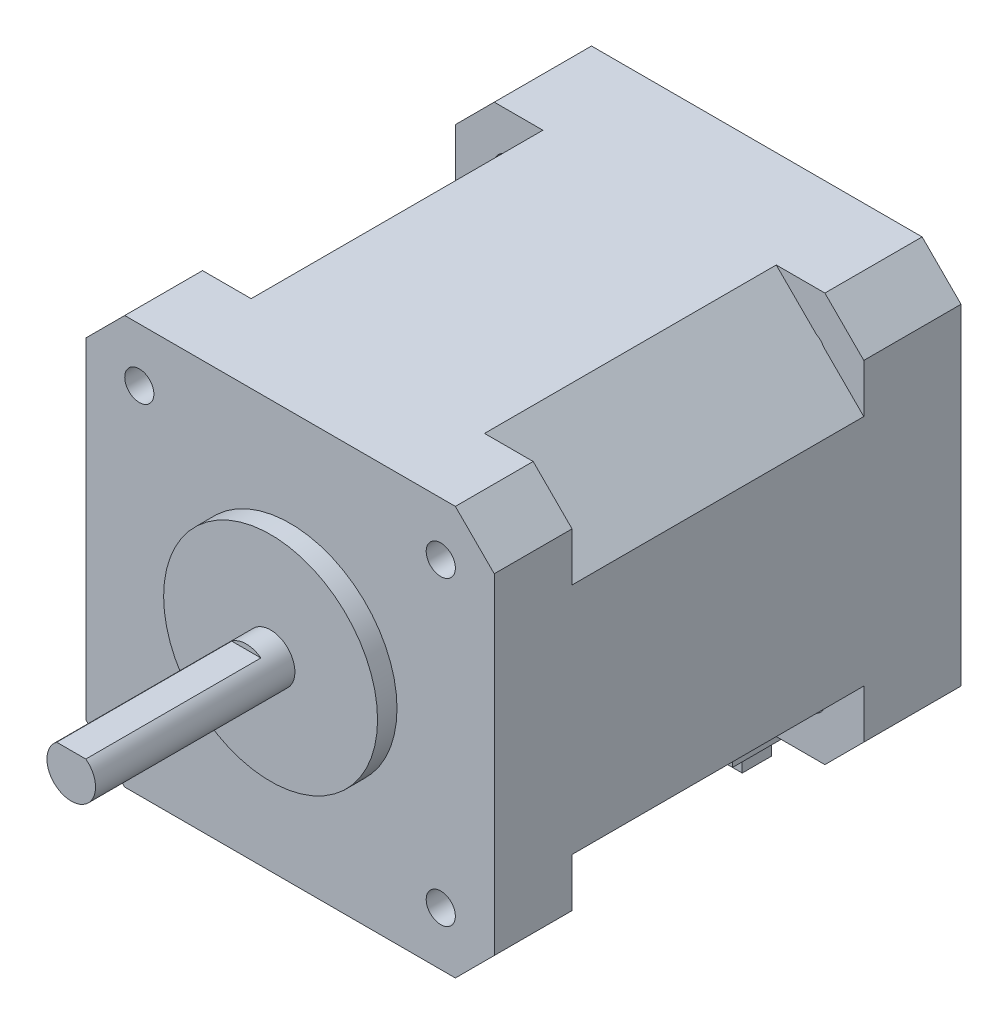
ISO-10303-21;
HEADER;
FILE_DESCRIPTION(('STEP AP214'),'2;1');
FILE_NAME('part.step','',(''),(''),'','','');
FILE_SCHEMA(('AUTOMOTIVE_DESIGN { 1 0 10303 214 1 1 1 1 }'));
ENDSEC;
DATA;
#1=APPLICATION_CONTEXT('core data for automotive mechanical design processes');
#2=APPLICATION_PROTOCOL_DEFINITION('international standard','automotive_design',2000,#1);
#3=PRODUCT_CONTEXT('',#1,'mechanical');
#4=PRODUCT('Part','Part','',(#3));
#5=PRODUCT_RELATED_PRODUCT_CATEGORY('part','',(#4));
#6=PRODUCT_DEFINITION_FORMATION('','',#4);
#7=PRODUCT_DEFINITION_CONTEXT('part definition',#1,'design');
#8=PRODUCT_DEFINITION('design','',#6,#7);
#9=PRODUCT_DEFINITION_SHAPE('','',#8);
#10=(LENGTH_UNIT() NAMED_UNIT(*) SI_UNIT(.MILLI.,.METRE.));
#11=(NAMED_UNIT(*) PLANE_ANGLE_UNIT() SI_UNIT($,.RADIAN.));
#12=(NAMED_UNIT(*) SI_UNIT($,.STERADIAN.) SOLID_ANGLE_UNIT());
#13=UNCERTAINTY_MEASURE_WITH_UNIT(LENGTH_MEASURE(1.E-05),#10,'distance_accuracy_value','');
#14=(GEOMETRIC_REPRESENTATION_CONTEXT(3) GLOBAL_UNCERTAINTY_ASSIGNED_CONTEXT((#13)) GLOBAL_UNIT_ASSIGNED_CONTEXT((#10,
#11,#12)) REPRESENTATION_CONTEXT('',''));
#15=CARTESIAN_POINT('',(0.,0.,0.));
#16=DIRECTION('',(0.,0.,1.));
#17=DIRECTION('',(1.,0.,0.));
#18=AXIS2_PLACEMENT_3D('',#15,#16,#17);
#19=CARTESIAN_POINT('',(0.,-27.,0.));
#20=DIRECTION('',(0.,-1.,0.));
#21=DIRECTION('',(1.,0.,0.));
#22=AXIS2_PLACEMENT_3D('',#19,#20,#21);
#23=PLANE('',#22);
#24=DIRECTION('',(0.,0.,1.));
#25=VECTOR('',#24,1.);
#26=CARTESIAN_POINT('',(-4.50000000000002,-27.,0.));
#27=LINE('',#26,#25);
#28=CARTESIAN_POINT('',(-4.5,-27.,-64.831429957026));
#29=VERTEX_POINT('',#28);
#30=CARTESIAN_POINT('',(-4.5,-27.,-62.5));
#31=VERTEX_POINT('',#30);
#32=EDGE_CURVE('E633',#29,#31,#27,.T.);
#33=ORIENTED_EDGE('',*,*,#32,.F.);
#34=DIRECTION('',(1.,0.,0.));
#35=VECTOR('',#34,1.);
#36=CARTESIAN_POINT('',(0.,-27.,-64.831429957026));
#37=LINE('',#36,#35);
#38=CARTESIAN_POINT('',(-3.5,-27.,-64.831429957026));
#39=VERTEX_POINT('',#38);
#40=EDGE_CURVE('E1246',#29,#39,#37,.T.);
#41=ORIENTED_EDGE('',*,*,#40,.T.);
#42=DIRECTION('',(0.,0.,-1.));
#43=VECTOR('',#42,1.);
#44=CARTESIAN_POINT('',(-3.50000000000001,-27.,0.));
#45=LINE('',#44,#43);
#46=CARTESIAN_POINT('',(-3.5,-27.,-62.5));
#47=VERTEX_POINT('',#46);
#48=EDGE_CURVE('E629',#47,#39,#45,.T.);
#49=ORIENTED_EDGE('',*,*,#48,.F.);
#50=DIRECTION('',(1.,0.,0.));
#51=VECTOR('',#50,1.);
#52=CARTESIAN_POINT('',(0.,-27.,-62.5));
#53=LINE('',#52,#51);
#54=EDGE_CURVE('E602',#31,#47,#53,.T.);
#55=ORIENTED_EDGE('',*,*,#54,.F.);
#56=EDGE_LOOP('',(#33,#41,#49,#55));
#57=FACE_BOUND('',#56,.T.);
#58=ADVANCED_FACE('F55',(#57),#23,.T.);
#59=DIRECTION('',(0.,0.,-1.));
#60=VECTOR('',#59,1.);
#61=CARTESIAN_POINT('',(-2.5,-27.,0.));
#62=LINE('',#61,#60);
#63=CARTESIAN_POINT('',(-2.5,-27.,-62.5));
#64=VERTEX_POINT('',#63);
#65=CARTESIAN_POINT('',(-2.5,-27.,-64.831429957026));
#66=VERTEX_POINT('',#65);
#67=EDGE_CURVE('E626',#64,#66,#62,.T.);
#68=ORIENTED_EDGE('',*,*,#67,.T.);
#69=CARTESIAN_POINT('',(-1.5,-27.,-64.831429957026));
#70=VERTEX_POINT('',#69);
#71=EDGE_CURVE('E1250',#66,#70,#37,.T.);
#72=ORIENTED_EDGE('',*,*,#71,.T.);
#73=DIRECTION('',(0.,0.,-1.));
#74=VECTOR('',#73,1.);
#75=CARTESIAN_POINT('',(-1.50000000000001,-27.,0.));
#76=LINE('',#75,#74);
#77=CARTESIAN_POINT('',(-1.5,-27.,-62.5));
#78=VERTEX_POINT('',#77);
#79=EDGE_CURVE('E621',#78,#70,#76,.T.);
#80=ORIENTED_EDGE('',*,*,#79,.F.);
#81=EDGE_CURVE('E625',#64,#78,#53,.T.);
#82=ORIENTED_EDGE('',*,*,#81,.F.);
#83=EDGE_LOOP('',(#68,#72,#80,#82));
#84=FACE_BOUND('',#83,.T.);
#85=ADVANCED_FACE('F1381',(#84),#23,.T.);
#86=DIRECTION('',(0.,0.,-1.));
#87=VECTOR('',#86,1.);
#88=CARTESIAN_POINT('',(-0.500000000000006,-27.,0.));
#89=LINE('',#88,#87);
#90=CARTESIAN_POINT('',(-0.5,-27.,-62.5));
#91=VERTEX_POINT('',#90);
#92=CARTESIAN_POINT('',(-0.5,-27.,-64.831429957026));
#93=VERTEX_POINT('',#92);
#94=EDGE_CURVE('E618',#91,#93,#89,.T.);
#95=ORIENTED_EDGE('',*,*,#94,.T.);
#96=CARTESIAN_POINT('',(0.5,-27.,-64.831429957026));
#97=VERTEX_POINT('',#96);
#98=EDGE_CURVE('E1256',#93,#97,#37,.T.);
#99=ORIENTED_EDGE('',*,*,#98,.T.);
#100=DIRECTION('',(0.,0.,-1.));
#101=VECTOR('',#100,1.);
#102=CARTESIAN_POINT('',(0.499999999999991,-27.,0.));
#103=LINE('',#102,#101);
#104=CARTESIAN_POINT('',(0.5,-27.,-62.5));
#105=VERTEX_POINT('',#104);
#106=EDGE_CURVE('E613',#105,#97,#103,.T.);
#107=ORIENTED_EDGE('',*,*,#106,.F.);
#108=EDGE_CURVE('E617',#91,#105,#53,.T.);
#109=ORIENTED_EDGE('',*,*,#108,.F.);
#110=EDGE_LOOP('',(#95,#99,#107,#109));
#111=FACE_BOUND('',#110,.T.);
#112=ADVANCED_FACE('F1386',(#111),#23,.T.);
#113=DIRECTION('',(0.,0.,-1.));
#114=VECTOR('',#113,1.);
#115=CARTESIAN_POINT('',(1.49999999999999,-27.,0.));
#116=LINE('',#115,#114);
#117=CARTESIAN_POINT('',(1.5,-27.,-62.5));
#118=VERTEX_POINT('',#117);
#119=CARTESIAN_POINT('',(1.5,-27.,-64.831429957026));
#120=VERTEX_POINT('',#119);
#121=EDGE_CURVE('E610',#118,#120,#116,.T.);
#122=ORIENTED_EDGE('',*,*,#121,.T.);
#123=CARTESIAN_POINT('',(2.5,-27.,-64.831429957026));
#124=VERTEX_POINT('',#123);
#125=EDGE_CURVE('E1245',#120,#124,#37,.T.);
#126=ORIENTED_EDGE('',*,*,#125,.T.);
#127=DIRECTION('',(0.,0.,-1.));
#128=VECTOR('',#127,1.);
#129=CARTESIAN_POINT('',(2.49999999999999,-27.,0.));
#130=LINE('',#129,#128);
#131=CARTESIAN_POINT('',(2.5,-27.,-62.5));
#132=VERTEX_POINT('',#131);
#133=EDGE_CURVE('E606',#132,#124,#130,.T.);
#134=ORIENTED_EDGE('',*,*,#133,.F.);
#135=EDGE_CURVE('E603',#118,#132,#53,.T.);
#136=ORIENTED_EDGE('',*,*,#135,.F.);
#137=EDGE_LOOP('',(#122,#126,#134,#136));
#138=FACE_BOUND('',#137,.T.);
#139=ADVANCED_FACE('F1271',(#138),#23,.T.);
#140=DIRECTION('',(0.,0.,-1.));
#141=VECTOR('',#140,1.);
#142=CARTESIAN_POINT('',(3.5,-27.,0.));
#143=LINE('',#142,#141);
#144=CARTESIAN_POINT('',(3.5,-27.,-62.5));
#145=VERTEX_POINT('',#144);
#146=CARTESIAN_POINT('',(3.5,-27.,-64.831429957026));
#147=VERTEX_POINT('',#146);
#148=EDGE_CURVE('E600',#145,#147,#143,.T.);
#149=ORIENTED_EDGE('',*,*,#148,.T.);
#150=CARTESIAN_POINT('',(4.5,-27.,-64.831429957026));
#151=VERTEX_POINT('',#150);
#152=EDGE_CURVE('E1243',#147,#151,#37,.T.);
#153=ORIENTED_EDGE('',*,*,#152,.T.);
#154=DIRECTION('',(0.,0.,1.));
#155=VECTOR('',#154,1.);
#156=CARTESIAN_POINT('',(4.49999999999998,-27.,0.));
#157=LINE('',#156,#155);
#158=CARTESIAN_POINT('',(4.5,-27.,-62.5));
#159=VERTEX_POINT('',#158);
#160=EDGE_CURVE('E637',#151,#159,#157,.T.);
#161=ORIENTED_EDGE('',*,*,#160,.T.);
#162=EDGE_CURVE('E596',#145,#159,#53,.T.);
#163=ORIENTED_EDGE('',*,*,#162,.F.);
#164=EDGE_LOOP('',(#149,#153,#161,#163));
#165=FACE_BOUND('',#164,.T.);
#166=ADVANCED_FACE('F1314',(#165),#23,.T.);
#167=CARTESIAN_POINT('',(0.,0.,-60.5));
#168=DIRECTION('',(0.,0.,1.));
#169=DIRECTION('',(1.,0.,0.));
#170=AXIS2_PLACEMENT_3D('',#167,#168,#169);
#171=PLANE('',#170);
#172=DIRECTION('',(0.,-1.,0.));
#173=VECTOR('',#172,1.);
#174=CARTESIAN_POINT('',(-5.5,-26.,-60.5));
#175=LINE('',#174,#173);
#176=CARTESIAN_POINT('',(-5.5,-21.,-60.5));
#177=VERTEX_POINT('',#176);
#178=CARTESIAN_POINT('',(-5.5,-26.,-60.5));
#179=VERTEX_POINT('',#178);
#180=EDGE_CURVE('E749',#177,#179,#175,.T.);
#181=ORIENTED_EDGE('',*,*,#180,.F.);
#182=DIRECTION('',(1.,0.,0.));
#183=VECTOR('',#182,1.);
#184=CARTESIAN_POINT('',(0.,-21.,-60.5));
#185=LINE('',#184,#183);
#186=CARTESIAN_POINT('',(-7.5,-21.,-60.5));
#187=VERTEX_POINT('',#186);
#188=EDGE_CURVE('E1239',#187,#177,#185,.T.);
#189=ORIENTED_EDGE('',*,*,#188,.F.);
#190=DIRECTION('',(0.,1.,0.));
#191=VECTOR('',#190,1.);
#192=CARTESIAN_POINT('',(-7.5,-16.,-60.5));
#193=LINE('',#192,#191);
#194=CARTESIAN_POINT('',(-7.5,-26.,-60.5));
#195=VERTEX_POINT('',#194);
#196=EDGE_CURVE('E783',#195,#187,#193,.T.);
#197=ORIENTED_EDGE('',*,*,#196,.F.);
#198=DIRECTION('',(-1.,0.,0.));
#199=VECTOR('',#198,1.);
#200=CARTESIAN_POINT('',(7.5,-26.,-60.5));
#201=LINE('',#200,#199);
#202=EDGE_CURVE('E792',#179,#195,#201,.T.);
#203=ORIENTED_EDGE('',*,*,#202,.F.);
#204=EDGE_LOOP('',(#181,#189,#197,#203));
#205=FACE_BOUND('',#204,.T.);
#206=ADVANCED_FACE('F1344',(#205),#171,.T.);
#207=CARTESIAN_POINT('',(-15.5,15.5,-70.5));
#208=DIRECTION('',(0.,0.,1.));
#209=DIRECTION('',(1.,0.,0.));
#210=AXIS2_PLACEMENT_3D('',#207,#208,#209);
#211=CYLINDRICAL_SURFACE('',#210,1.5);
#212=DIRECTION('',(0.,0.,1.));
#213=VECTOR('',#212,1.);
#214=CARTESIAN_POINT('',(-16.8535533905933,16.1464466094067,-70.5));
#215=LINE('',#214,#213);
#216=CARTESIAN_POINT('',(-16.8535533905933,16.1464466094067,-70.5));
#217=VERTEX_POINT('',#216);
#218=CARTESIAN_POINT('',(-16.8535533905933,16.1464466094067,-60.5));
#219=VERTEX_POINT('',#218);
#220=EDGE_CURVE('E856',#217,#219,#215,.T.);
#221=ORIENTED_EDGE('',*,*,#220,.F.);
#222=CARTESIAN_POINT('',(-15.5,15.5,-70.5));
#223=DIRECTION('',(0.,0.,-1.));
#224=DIRECTION('',(-1.,0.,0.));
#225=AXIS2_PLACEMENT_3D('',#222,#223,#224);
#226=CIRCLE('',#225,1.5);
#227=CARTESIAN_POINT('',(-16.1464466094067,16.8535533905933,-70.5));
#228=VERTEX_POINT('',#227);
#229=EDGE_CURVE('E1041',#217,#228,#226,.T.);
#230=ORIENTED_EDGE('',*,*,#229,.T.);
#231=DIRECTION('',(0.,0.,1.));
#232=VECTOR('',#231,1.);
#233=CARTESIAN_POINT('',(-16.1464466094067,16.8535533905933,-70.5));
#234=LINE('',#233,#232);
#235=CARTESIAN_POINT('',(-16.1464466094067,16.8535533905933,-60.5));
#236=VERTEX_POINT('',#235);
#237=EDGE_CURVE('E848',#236,#228,#234,.F.);
#238=ORIENTED_EDGE('',*,*,#237,.F.);
#239=CARTESIAN_POINT('',(-15.5,15.5,-60.5));
#240=DIRECTION('',(0.,0.,-1.));
#241=DIRECTION('',(-1.,0.,0.));
#242=AXIS2_PLACEMENT_3D('',#239,#240,#241);
#243=CIRCLE('',#242,1.5);
#244=EDGE_CURVE('E1210',#219,#236,#243,.T.);
#245=ORIENTED_EDGE('',*,*,#244,.F.);
#246=EDGE_LOOP('',(#221,#230,#238,#245));
#247=FACE_BOUND('',#246,.T.);
#248=ADVANCED_FACE('F1393',(#247),#211,.F.);
#249=CARTESIAN_POINT('',(-15.5,-15.5,-70.5));
#250=DIRECTION('',(0.,0.,1.));
#251=DIRECTION('',(1.,0.,0.));
#252=AXIS2_PLACEMENT_3D('',#249,#250,#251);
#253=CYLINDRICAL_SURFACE('',#252,1.5);
#254=DIRECTION('',(0.,0.,1.));
#255=VECTOR('',#254,1.);
#256=CARTESIAN_POINT('',(-16.1464466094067,-16.8535533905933,-70.5));
#257=LINE('',#256,#255);
#258=CARTESIAN_POINT('',(-16.1464466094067,-16.8535533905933,-70.5));
#259=VERTEX_POINT('',#258);
#260=CARTESIAN_POINT('',(-16.1464466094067,-16.8535533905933,-60.5));
#261=VERTEX_POINT('',#260);
#262=EDGE_CURVE('E837',#259,#261,#257,.T.);
#263=ORIENTED_EDGE('',*,*,#262,.F.);
#264=CARTESIAN_POINT('',(-15.5,-15.5,-70.5));
#265=DIRECTION('',(0.,0.,-1.));
#266=DIRECTION('',(-1.,0.,0.));
#267=AXIS2_PLACEMENT_3D('',#264,#265,#266);
#268=CIRCLE('',#267,1.5);
#269=CARTESIAN_POINT('',(-16.8535533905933,-16.1464466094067,-70.5));
#270=VERTEX_POINT('',#269);
#271=EDGE_CURVE('E1050',#259,#270,#268,.T.);
#272=ORIENTED_EDGE('',*,*,#271,.T.);
#273=DIRECTION('',(0.,0.,1.));
#274=VECTOR('',#273,1.);
#275=CARTESIAN_POINT('',(-16.8535533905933,-16.1464466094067,-70.5));
#276=LINE('',#275,#274);
#277=CARTESIAN_POINT('',(-16.8535533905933,-16.1464466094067,-60.5));
#278=VERTEX_POINT('',#277);
#279=EDGE_CURVE('E822',#278,#270,#276,.F.);
#280=ORIENTED_EDGE('',*,*,#279,.F.);
#281=CARTESIAN_POINT('',(-15.5,-15.5,-60.5));
#282=DIRECTION('',(0.,0.,1.));
#283=DIRECTION('',(1.,0.,0.));
#284=AXIS2_PLACEMENT_3D('',#281,#282,#283);
#285=CIRCLE('',#284,1.5);
#286=EDGE_CURVE('E1226',#278,#261,#285,.T.);
#287=ORIENTED_EDGE('',*,*,#286,.T.);
#288=EDGE_LOOP('',(#263,#272,#280,#287));
#289=FACE_BOUND('',#288,.T.);
#290=ADVANCED_FACE('F1568',(#289),#253,.F.);
#291=CARTESIAN_POINT('',(15.5,-15.5,-70.5));
#292=DIRECTION('',(0.,0.,1.));
#293=DIRECTION('',(1.,0.,0.));
#294=AXIS2_PLACEMENT_3D('',#291,#292,#293);
#295=CYLINDRICAL_SURFACE('',#294,1.5);
#296=DIRECTION('',(0.,0.,1.));
#297=VECTOR('',#296,1.);
#298=CARTESIAN_POINT('',(16.8535533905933,-16.1464466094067,-70.5));
#299=LINE('',#298,#297);
#300=CARTESIAN_POINT('',(16.8535533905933,-16.1464466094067,-70.5));
#301=VERTEX_POINT('',#300);
#302=CARTESIAN_POINT('',(16.8535533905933,-16.1464466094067,-60.5));
#303=VERTEX_POINT('',#302);
#304=EDGE_CURVE('E845',#301,#303,#299,.T.);
#305=ORIENTED_EDGE('',*,*,#304,.F.);
#306=CARTESIAN_POINT('',(15.5,-15.5,-70.5));
#307=DIRECTION('',(0.,0.,-1.));
#308=DIRECTION('',(-1.,0.,0.));
#309=AXIS2_PLACEMENT_3D('',#306,#307,#308);
#310=CIRCLE('',#309,1.5);
#311=CARTESIAN_POINT('',(16.1464466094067,-16.8535533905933,-70.5));
#312=VERTEX_POINT('',#311);
#313=EDGE_CURVE('E1046',#301,#312,#310,.T.);
#314=ORIENTED_EDGE('',*,*,#313,.T.);
#315=DIRECTION('',(0.,0.,1.));
#316=VECTOR('',#315,1.);
#317=CARTESIAN_POINT('',(16.1464466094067,-16.8535533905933,-70.5));
#318=LINE('',#317,#316);
#319=CARTESIAN_POINT('',(16.1464466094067,-16.8535533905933,-60.5));
#320=VERTEX_POINT('',#319);
#321=EDGE_CURVE('E840',#320,#312,#318,.F.);
#322=ORIENTED_EDGE('',*,*,#321,.F.);
#323=CARTESIAN_POINT('',(15.5,-15.5,-60.5));
#324=DIRECTION('',(0.,0.,1.));
#325=DIRECTION('',(1.,0.,0.));
#326=AXIS2_PLACEMENT_3D('',#323,#324,#325);
#327=CIRCLE('',#326,1.5);
#328=EDGE_CURVE('E1218',#320,#303,#327,.T.);
#329=ORIENTED_EDGE('',*,*,#328,.T.);
#330=EDGE_LOOP('',(#305,#314,#322,#329));
#331=FACE_BOUND('',#330,.T.);
#332=ADVANCED_FACE('F1572',(#331),#295,.F.);
#333=CARTESIAN_POINT('',(15.5,15.5,-70.5));
#334=DIRECTION('',(0.,0.,1.));
#335=DIRECTION('',(1.,0.,0.));
#336=AXIS2_PLACEMENT_3D('',#333,#334,#335);
#337=CYLINDRICAL_SURFACE('',#336,1.5);
#338=DIRECTION('',(0.,0.,1.));
#339=VECTOR('',#338,1.);
#340=CARTESIAN_POINT('',(16.1464466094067,16.8535533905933,-70.5));
#341=LINE('',#340,#339);
#342=CARTESIAN_POINT('',(16.1464466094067,16.8535533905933,-70.5));
#343=VERTEX_POINT('',#342);
#344=CARTESIAN_POINT('',(16.1464466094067,16.8535533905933,-60.5));
#345=VERTEX_POINT('',#344);
#346=EDGE_CURVE('E861',#343,#345,#341,.T.);
#347=ORIENTED_EDGE('',*,*,#346,.F.);
#348=CARTESIAN_POINT('',(15.5,15.5,-70.5));
#349=DIRECTION('',(0.,0.,-1.));
#350=DIRECTION('',(-1.,0.,0.));
#351=AXIS2_PLACEMENT_3D('',#348,#349,#350);
#352=CIRCLE('',#351,1.5);
#353=CARTESIAN_POINT('',(16.8535533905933,16.1464466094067,-70.5));
#354=VERTEX_POINT('',#353);
#355=EDGE_CURVE('E1037',#343,#354,#352,.T.);
#356=ORIENTED_EDGE('',*,*,#355,.T.);
#357=DIRECTION('',(0.,0.,1.));
#358=VECTOR('',#357,1.);
#359=CARTESIAN_POINT('',(16.8535533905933,16.1464466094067,-70.5));
#360=LINE('',#359,#358);
#361=CARTESIAN_POINT('',(16.8535533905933,16.1464466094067,-60.5));
#362=VERTEX_POINT('',#361);
#363=EDGE_CURVE('E859',#362,#354,#360,.F.);
#364=ORIENTED_EDGE('',*,*,#363,.F.);
#365=CARTESIAN_POINT('',(15.5,15.5,-60.5));
#366=DIRECTION('',(0.,0.,1.));
#367=DIRECTION('',(1.,0.,0.));
#368=AXIS2_PLACEMENT_3D('',#365,#366,#367);
#369=CIRCLE('',#368,1.5);
#370=EDGE_CURVE('E1004',#362,#345,#369,.T.);
#371=ORIENTED_EDGE('',*,*,#370,.T.);
#372=EDGE_LOOP('',(#347,#356,#364,#371));
#373=FACE_BOUND('',#372,.T.);
#374=ADVANCED_FACE('F1579',(#373),#337,.F.);
#375=CARTESIAN_POINT('',(19.,-19.,-70.5));
#376=DIRECTION('',(-0.707106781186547,0.707106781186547,0.));
#377=DIRECTION('',(-0.707106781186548,-0.707106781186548,0.));
#378=AXIS2_PLACEMENT_3D('',#375,#376,#377);
#379=PLANE('',#378);
#380=DIRECTION('',(0.707106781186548,0.707106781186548,0.));
#381=VECTOR('',#380,1.);
#382=CARTESIAN_POINT('',(19.,-19.,-60.5));
#383=LINE('',#382,#381);
#384=CARTESIAN_POINT('',(17.,-21.,-60.5));
#385=VERTEX_POINT('',#384);
#386=CARTESIAN_POINT('',(21.,-17.,-60.5));
#387=VERTEX_POINT('',#386);
#388=EDGE_CURVE('E1022',#385,#387,#383,.T.);
#389=ORIENTED_EDGE('',*,*,#388,.F.);
#390=DIRECTION('',(0.,0.,1.));
#391=VECTOR('',#390,1.);
#392=CARTESIAN_POINT('',(17.,-21.,-70.5));
#393=LINE('',#392,#391);
#394=CARTESIAN_POINT('',(17.,-21.,-70.5));
#395=VERTEX_POINT('',#394);
#396=EDGE_CURVE('E1160',#395,#385,#393,.T.);
#397=ORIENTED_EDGE('',*,*,#396,.F.);
#398=DIRECTION('',(-0.707106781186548,-0.707106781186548,0.));
#399=VECTOR('',#398,1.);
#400=CARTESIAN_POINT('',(19.,-19.,-70.5));
#401=LINE('',#400,#399);
#402=CARTESIAN_POINT('',(21.,-17.,-70.5));
#403=VERTEX_POINT('',#402);
#404=EDGE_CURVE('E1057',#403,#395,#401,.T.);
#405=ORIENTED_EDGE('',*,*,#404,.F.);
#406=DIRECTION('',(0.,0.,1.));
#407=VECTOR('',#406,1.);
#408=CARTESIAN_POINT('',(21.,-17.,-70.5));
#409=LINE('',#408,#407);
#410=EDGE_CURVE('E1165',#403,#387,#409,.T.);
#411=ORIENTED_EDGE('',*,*,#410,.T.);
#412=EDGE_LOOP('',(#389,#397,#405,#411));
#413=FACE_BOUND('',#412,.T.);
#414=ADVANCED_FACE('F1559',(#413),#379,.F.);
#415=CARTESIAN_POINT('',(-19.,-19.,-70.5));
#416=DIRECTION('',(0.707106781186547,0.707106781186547,0.));
#417=DIRECTION('',(-0.707106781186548,0.707106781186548,0.));
#418=AXIS2_PLACEMENT_3D('',#415,#416,#417);
#419=PLANE('',#418);
#420=DIRECTION('',(0.707106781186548,-0.707106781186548,0.));
#421=VECTOR('',#420,1.);
#422=CARTESIAN_POINT('',(-19.,-19.,-60.5));
#423=LINE('',#422,#421);
#424=CARTESIAN_POINT('',(-21.,-17.,-60.5));
#425=VERTEX_POINT('',#424);
#426=CARTESIAN_POINT('',(-17.,-21.,-60.5));
#427=VERTEX_POINT('',#426);
#428=EDGE_CURVE('E1029',#425,#427,#423,.T.);
#429=ORIENTED_EDGE('',*,*,#428,.F.);
#430=DIRECTION('',(0.,0.,1.));
#431=VECTOR('',#430,1.);
#432=CARTESIAN_POINT('',(-21.,-17.,-70.5));
#433=LINE('',#432,#431);
#434=CARTESIAN_POINT('',(-21.,-17.,-70.5));
#435=VERTEX_POINT('',#434);
#436=EDGE_CURVE('E1150',#435,#425,#433,.T.);
#437=ORIENTED_EDGE('',*,*,#436,.F.);
#438=DIRECTION('',(-0.707106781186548,0.707106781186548,0.));
#439=VECTOR('',#438,1.);
#440=CARTESIAN_POINT('',(-19.,-19.,-70.5));
#441=LINE('',#440,#439);
#442=CARTESIAN_POINT('',(-17.,-21.,-70.5));
#443=VERTEX_POINT('',#442);
#444=EDGE_CURVE('E1065',#443,#435,#441,.T.);
#445=ORIENTED_EDGE('',*,*,#444,.F.);
#446=DIRECTION('',(0.,0.,1.));
#447=VECTOR('',#446,1.);
#448=CARTESIAN_POINT('',(-17.,-21.,-70.5));
#449=LINE('',#448,#447);
#450=EDGE_CURVE('E1155',#443,#427,#449,.T.);
#451=ORIENTED_EDGE('',*,*,#450,.T.);
#452=EDGE_LOOP('',(#429,#437,#445,#451));
#453=FACE_BOUND('',#452,.T.);
#454=ADVANCED_FACE('F1547',(#453),#419,.F.);
#455=CARTESIAN_POINT('',(-21.,0.,-70.5));
#456=DIRECTION('',(-1.,0.,0.));
#457=DIRECTION('',(0.,-1.,0.));
#458=AXIS2_PLACEMENT_3D('',#455,#456,#457);
#459=PLANE('',#458);
#460=DIRECTION('',(0.,1.,0.));
#461=VECTOR('',#460,1.);
#462=CARTESIAN_POINT('',(-21.,12.,-30.5));
#463=LINE('',#462,#461);
#464=CARTESIAN_POINT('',(-21.,12.,-30.5));
#465=VERTEX_POINT('',#464);
#466=CARTESIAN_POINT('',(-21.,17.,-30.5));
#467=VERTEX_POINT('',#466);
#468=EDGE_CURVE('E912',#465,#467,#463,.T.);
#469=ORIENTED_EDGE('',*,*,#468,.F.);
#470=DIRECTION('',(0.,0.,-1.));
#471=VECTOR('',#470,1.);
#472=CARTESIAN_POINT('',(-21.,12.,-30.5));
#473=LINE('',#472,#471);
#474=CARTESIAN_POINT('',(-21.,12.,-60.5));
#475=VERTEX_POINT('',#474);
#476=EDGE_CURVE('E886',#465,#475,#473,.T.);
#477=ORIENTED_EDGE('',*,*,#476,.T.);
#478=DIRECTION('',(0.,1.,0.));
#479=VECTOR('',#478,1.);
#480=CARTESIAN_POINT('',(-21.,12.,-60.5));
#481=LINE('',#480,#479);
#482=CARTESIAN_POINT('',(-21.,17.,-60.5));
#483=VERTEX_POINT('',#482);
#484=EDGE_CURVE('E900',#475,#483,#481,.T.);
#485=ORIENTED_EDGE('',*,*,#484,.T.);
#486=DIRECTION('',(0.,0.,1.));
#487=VECTOR('',#486,1.);
#488=CARTESIAN_POINT('',(-21.,17.,-70.5));
#489=LINE('',#488,#487);
#490=CARTESIAN_POINT('',(-21.,17.,-70.5));
#491=VERTEX_POINT('',#490);
#492=EDGE_CURVE('E1145',#491,#483,#489,.T.);
#493=ORIENTED_EDGE('',*,*,#492,.F.);
#494=DIRECTION('',(0.,-1.,0.));
#495=VECTOR('',#494,1.);
#496=CARTESIAN_POINT('',(-21.,0.,-70.5));
#497=LINE('',#496,#495);
#498=EDGE_CURVE('E1069',#491,#435,#497,.T.);
#499=ORIENTED_EDGE('',*,*,#498,.T.);
#500=ORIENTED_EDGE('',*,*,#436,.T.);
#501=DIRECTION('',(0.,1.,0.));
#502=VECTOR('',#501,1.);
#503=CARTESIAN_POINT('',(-21.,-21.,-60.5));
#504=LINE('',#503,#502);
#505=CARTESIAN_POINT('',(-21.,-12.,-60.5));
#506=VERTEX_POINT('',#505);
#507=EDGE_CURVE('E992',#425,#506,#504,.T.);
#508=ORIENTED_EDGE('',*,*,#507,.T.);
#509=DIRECTION('',(0.,0.,-1.));
#510=VECTOR('',#509,1.);
#511=CARTESIAN_POINT('',(-21.,-12.,-30.5));
#512=LINE('',#511,#510);
#513=CARTESIAN_POINT('',(-21.,-12.,-30.5));
#514=VERTEX_POINT('',#513);
#515=EDGE_CURVE('E988',#514,#506,#512,.T.);
#516=ORIENTED_EDGE('',*,*,#515,.F.);
#517=DIRECTION('',(0.,1.,0.));
#518=VECTOR('',#517,1.);
#519=CARTESIAN_POINT('',(-21.,-21.,-30.5));
#520=LINE('',#519,#518);
#521=CARTESIAN_POINT('',(-21.,-17.,-30.5));
#522=VERTEX_POINT('',#521);
#523=EDGE_CURVE('E979',#522,#514,#520,.T.);
#524=ORIENTED_EDGE('',*,*,#523,.F.);
#525=CARTESIAN_POINT('',(-21.,-17.,-22.5));
#526=VERTEX_POINT('',#525);
#527=EDGE_CURVE('E1149',#522,#526,#433,.T.);
#528=ORIENTED_EDGE('',*,*,#527,.T.);
#529=DIRECTION('',(0.,-1.,0.));
#530=VECTOR('',#529,1.);
#531=CARTESIAN_POINT('',(-21.,0.,-22.5));
#532=LINE('',#531,#530);
#533=CARTESIAN_POINT('',(-21.,17.,-22.5));
#534=VERTEX_POINT('',#533);
#535=EDGE_CURVE('E1115',#534,#526,#532,.T.);
#536=ORIENTED_EDGE('',*,*,#535,.F.);
#537=EDGE_CURVE('E1144',#467,#534,#489,.T.);
#538=ORIENTED_EDGE('',*,*,#537,.F.);
#539=EDGE_LOOP('',(#469,#477,#485,#493,#499,#500,#508,#516,#524,#528,#536,#538));
#540=FACE_BOUND('',#539,.T.);
#541=ADVANCED_FACE('F1544',(#540),#459,.T.);
#542=CARTESIAN_POINT('',(-19.,19.,-70.5));
#543=DIRECTION('',(-0.707106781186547,0.707106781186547,0.));
#544=DIRECTION('',(-0.707106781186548,-0.707106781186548,0.));
#545=AXIS2_PLACEMENT_3D('',#542,#543,#544);
#546=PLANE('',#545);
#547=DIRECTION('',(0.,0.,1.));
#548=VECTOR('',#547,1.);
#549=CARTESIAN_POINT('',(-17.,21.,-70.5));
#550=LINE('',#549,#548);
#551=CARTESIAN_POINT('',(-17.,21.,-30.5));
#552=VERTEX_POINT('',#551);
#553=CARTESIAN_POINT('',(-17.,21.,-22.5));
#554=VERTEX_POINT('',#553);
#555=EDGE_CURVE('E1139',#552,#554,#550,.T.);
#556=ORIENTED_EDGE('',*,*,#555,.F.);
#557=DIRECTION('',(-0.707106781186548,-0.707106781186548,0.));
#558=VECTOR('',#557,1.);
#559=CARTESIAN_POINT('',(-19.,19.,-30.5));
#560=LINE('',#559,#558);
#561=EDGE_CURVE('E1018',#552,#467,#560,.T.);
#562=ORIENTED_EDGE('',*,*,#561,.T.);
#563=ORIENTED_EDGE('',*,*,#537,.T.);
#564=DIRECTION('',(-0.707106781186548,-0.707106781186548,0.));
#565=VECTOR('',#564,1.);
#566=CARTESIAN_POINT('',(-19.,19.,-22.5));
#567=LINE('',#566,#565);
#568=EDGE_CURVE('E1119',#554,#534,#567,.T.);
#569=ORIENTED_EDGE('',*,*,#568,.F.);
#570=EDGE_LOOP('',(#556,#562,#563,#569));
#571=FACE_BOUND('',#570,.T.);
#572=ADVANCED_FACE('F1536',(#571),#546,.T.);
#573=CARTESIAN_POINT('',(0.,21.,-70.5));
#574=DIRECTION('',(0.,1.,0.));
#575=DIRECTION('',(0.,0.,1.));
#576=AXIS2_PLACEMENT_3D('',#573,#574,#575);
#577=PLANE('',#576);
#578=DIRECTION('',(1.,0.,0.));
#579=VECTOR('',#578,1.);
#580=CARTESIAN_POINT('',(12.,21.,-30.5));
#581=LINE('',#580,#579);
#582=CARTESIAN_POINT('',(12.,21.,-30.5));
#583=VERTEX_POINT('',#582);
#584=CARTESIAN_POINT('',(17.,21.,-30.5));
#585=VERTEX_POINT('',#584);
#586=EDGE_CURVE('E943',#583,#585,#581,.T.);
#587=ORIENTED_EDGE('',*,*,#586,.F.);
#588=DIRECTION('',(0.,0.,-1.));
#589=VECTOR('',#588,1.);
#590=CARTESIAN_POINT('',(12.,21.,-30.5));
#591=LINE('',#590,#589);
#592=CARTESIAN_POINT('',(12.,21.,-60.5));
#593=VERTEX_POINT('',#592);
#594=EDGE_CURVE('E919',#583,#593,#591,.T.);
#595=ORIENTED_EDGE('',*,*,#594,.T.);
#596=DIRECTION('',(1.,0.,0.));
#597=VECTOR('',#596,1.);
#598=CARTESIAN_POINT('',(12.,21.,-60.5));
#599=LINE('',#598,#597);
#600=CARTESIAN_POINT('',(17.,21.,-60.5));
#601=VERTEX_POINT('',#600);
#602=EDGE_CURVE('E890',#593,#601,#599,.T.);
#603=ORIENTED_EDGE('',*,*,#602,.T.);
#604=DIRECTION('',(0.,0.,1.));
#605=VECTOR('',#604,1.);
#606=CARTESIAN_POINT('',(17.,21.,-70.5));
#607=LINE('',#606,#605);
#608=CARTESIAN_POINT('',(17.,21.,-70.5));
#609=VERTEX_POINT('',#608);
#610=EDGE_CURVE('E1135',#609,#601,#607,.T.);
#611=ORIENTED_EDGE('',*,*,#610,.F.);
#612=DIRECTION('',(-1.,0.,0.));
#613=VECTOR('',#612,1.);
#614=CARTESIAN_POINT('',(0.,21.,-70.5));
#615=LINE('',#614,#613);
#616=CARTESIAN_POINT('',(-17.,21.,-70.5));
#617=VERTEX_POINT('',#616);
#618=EDGE_CURVE('E1076',#609,#617,#615,.T.);
#619=ORIENTED_EDGE('',*,*,#618,.T.);
#620=CARTESIAN_POINT('',(-17.,21.,-60.5));
#621=VERTEX_POINT('',#620);
#622=EDGE_CURVE('E1140',#617,#621,#550,.T.);
#623=ORIENTED_EDGE('',*,*,#622,.T.);
#624=DIRECTION('',(1.,0.,0.));
#625=VECTOR('',#624,1.);
#626=CARTESIAN_POINT('',(-21.,21.,-60.5));
#627=LINE('',#626,#625);
#628=CARTESIAN_POINT('',(-12.,21.,-60.5));
#629=VERTEX_POINT('',#628);
#630=EDGE_CURVE('E895',#621,#629,#627,.T.);
#631=ORIENTED_EDGE('',*,*,#630,.T.);
#632=DIRECTION('',(0.,0.,-1.));
#633=VECTOR('',#632,1.);
#634=CARTESIAN_POINT('',(-12.,21.,-30.5));
#635=LINE('',#634,#633);
#636=CARTESIAN_POINT('',(-12.,21.,-30.5));
#637=VERTEX_POINT('',#636);
#638=EDGE_CURVE('E881',#637,#629,#635,.T.);
#639=ORIENTED_EDGE('',*,*,#638,.F.);
#640=DIRECTION('',(1.,0.,0.));
#641=VECTOR('',#640,1.);
#642=CARTESIAN_POINT('',(-21.,21.,-30.5));
#643=LINE('',#642,#641);
#644=EDGE_CURVE('E909',#552,#637,#643,.T.);
#645=ORIENTED_EDGE('',*,*,#644,.F.);
#646=ORIENTED_EDGE('',*,*,#555,.T.);
#647=DIRECTION('',(-1.,0.,0.));
#648=VECTOR('',#647,1.);
#649=CARTESIAN_POINT('',(0.,21.,-22.5));
#650=LINE('',#649,#648);
#651=CARTESIAN_POINT('',(17.,21.,-22.5));
#652=VERTEX_POINT('',#651);
#653=EDGE_CURVE('E1123',#652,#554,#650,.T.);
#654=ORIENTED_EDGE('',*,*,#653,.F.);
#655=EDGE_CURVE('E1134',#585,#652,#607,.T.);
#656=ORIENTED_EDGE('',*,*,#655,.F.);
#657=EDGE_LOOP('',(#587,#595,#603,#611,#619,#623,#631,#639,#645,#646,#654,#656));
#658=FACE_BOUND('',#657,.T.);
#659=ADVANCED_FACE('F1532',(#658),#577,.T.);
#660=CARTESIAN_POINT('',(-16.8535533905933,16.1464466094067,-30.5));
#661=VERTEX_POINT('',#660);
#662=CARTESIAN_POINT('',(-16.8535533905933,16.1464466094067,-27.));
#663=VERTEX_POINT('',#662);
#664=EDGE_CURVE('E860',#661,#663,#215,.T.);
#665=ORIENTED_EDGE('',*,*,#664,.F.);
#666=CARTESIAN_POINT('',(-15.5,15.5,-30.5));
#667=DIRECTION('',(0.,0.,-1.));
#668=DIRECTION('',(-1.,0.,0.));
#669=AXIS2_PLACEMENT_3D('',#666,#667,#668);
#670=CIRCLE('',#669,1.5);
#671=CARTESIAN_POINT('',(-16.1464466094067,16.8535533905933,-30.5));
#672=VERTEX_POINT('',#671);
#673=EDGE_CURVE('E1214',#661,#672,#670,.T.);
#674=ORIENTED_EDGE('',*,*,#673,.T.);
#675=CARTESIAN_POINT('',(-16.1464466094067,16.8535533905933,-27.));
#676=VERTEX_POINT('',#675);
#677=EDGE_CURVE('E855',#676,#672,#234,.F.);
#678=ORIENTED_EDGE('',*,*,#677,.F.);
#679=CARTESIAN_POINT('',(-15.5,15.5,-27.));
#680=DIRECTION('',(0.,0.,-1.));
#681=DIRECTION('',(-1.,0.,0.));
#682=AXIS2_PLACEMENT_3D('',#679,#680,#681);
#683=CIRCLE('',#682,1.5);
#684=EDGE_CURVE('E876',#676,#663,#683,.T.);
#685=ORIENTED_EDGE('',*,*,#684,.T.);
#686=EDGE_LOOP('',(#665,#674,#678,#685));
#687=FACE_BOUND('',#686,.T.);
#688=CARTESIAN_POINT('',(-15.5,15.5,-22.5));
#689=DIRECTION('',(0.,0.,-1.));
#690=DIRECTION('',(-1.,0.,0.));
#691=AXIS2_PLACEMENT_3D('',#688,#689,#690);
#692=CIRCLE('',#691,1.5);
#693=CARTESIAN_POINT('',(-17.,15.5,-22.5));
#694=VERTEX_POINT('',#693);
#695=EDGE_CURVE('E1087',#694,#694,#692,.T.);
#696=ORIENTED_EDGE('',*,*,#695,.F.);
#697=EDGE_LOOP('',(#696));
#698=FACE_BOUND('',#697,.T.);
#699=ADVANCED_FACE('F1535',(#687,#698),#211,.F.);
#700=CARTESIAN_POINT('',(19.,19.,-70.5));
#701=DIRECTION('',(0.707106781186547,0.707106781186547,0.));
#702=DIRECTION('',(-0.707106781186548,0.707106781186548,0.));
#703=AXIS2_PLACEMENT_3D('',#700,#701,#702);
#704=PLANE('',#703);
#705=ORIENTED_EDGE('',*,*,#610,.T.);
#706=DIRECTION('',(0.707106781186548,-0.707106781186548,0.));
#707=VECTOR('',#706,1.);
#708=CARTESIAN_POINT('',(19.,19.,-60.5));
#709=LINE('',#708,#707);
#710=CARTESIAN_POINT('',(21.,17.,-60.5));
#711=VERTEX_POINT('',#710);
#712=EDGE_CURVE('E1198',#601,#711,#709,.T.);
#713=ORIENTED_EDGE('',*,*,#712,.T.);
#714=DIRECTION('',(0.,0.,1.));
#715=VECTOR('',#714,1.);
#716=CARTESIAN_POINT('',(21.,17.,-70.5));
#717=LINE('',#716,#715);
#718=CARTESIAN_POINT('',(21.,17.,-70.5));
#719=VERTEX_POINT('',#718);
#720=EDGE_CURVE('E1130',#719,#711,#717,.T.);
#721=ORIENTED_EDGE('',*,*,#720,.F.);
#722=DIRECTION('',(-0.707106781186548,0.707106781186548,0.));
#723=VECTOR('',#722,1.);
#724=CARTESIAN_POINT('',(19.,19.,-70.5));
#725=LINE('',#724,#723);
#726=EDGE_CURVE('E1079',#719,#609,#725,.T.);
#727=ORIENTED_EDGE('',*,*,#726,.T.);
#728=EDGE_LOOP('',(#705,#713,#721,#727));
#729=FACE_BOUND('',#728,.T.);
#730=ADVANCED_FACE('F1531',(#729),#704,.T.);
#731=CARTESIAN_POINT('',(0.,0.,-18.));
#732=DIRECTION('',(0.,0.,1.));
#733=DIRECTION('',(1.,0.,0.));
#734=AXIS2_PLACEMENT_3D('',#731,#732,#733);
#735=CYLINDRICAL_SURFACE('',#734,2.5);
#736=CARTESIAN_POINT('',(0.,0.,0.));
#737=DIRECTION('',(0.,0.,1.));
#738=DIRECTION('',(1.,0.,0.));
#739=AXIS2_PLACEMENT_3D('',#736,#737,#738);
#740=CIRCLE('',#739,2.5);
#741=CARTESIAN_POINT('',(-1.5,2.,0.));
#742=VERTEX_POINT('',#741);
#743=CARTESIAN_POINT('',(1.5,2.,0.));
#744=VERTEX_POINT('',#743);
#745=EDGE_CURVE('E1182',#742,#744,#740,.T.);
#746=ORIENTED_EDGE('',*,*,#745,.F.);
#747=DIRECTION('',(0.,0.,1.));
#748=VECTOR('',#747,1.);
#749=CARTESIAN_POINT('',(-1.5,2.,-18.));
#750=LINE('',#749,#748);
#751=CARTESIAN_POINT('',(-1.5,2.,-18.));
#752=VERTEX_POINT('',#751);
#753=EDGE_CURVE('E1195',#752,#742,#750,.T.);
#754=ORIENTED_EDGE('',*,*,#753,.F.);
#755=CARTESIAN_POINT('',(0.,0.,-18.));
#756=DIRECTION('',(0.,0.,-1.));
#757=DIRECTION('',(-1.,0.,0.));
#758=AXIS2_PLACEMENT_3D('',#755,#756,#757);
#759=CIRCLE('',#758,2.5);
#760=CARTESIAN_POINT('',(1.5,2.,-18.));
#761=VERTEX_POINT('',#760);
#762=EDGE_CURVE('E1178',#752,#761,#759,.T.);
#763=ORIENTED_EDGE('',*,*,#762,.T.);
#764=DIRECTION('',(0.,0.,1.));
#765=VECTOR('',#764,1.);
#766=CARTESIAN_POINT('',(1.5,2.,-18.));
#767=LINE('',#766,#765);
#768=EDGE_CURVE('E1187',#761,#744,#767,.T.);
#769=ORIENTED_EDGE('',*,*,#768,.T.);
#770=EDGE_LOOP('',(#746,#754,#763,#769));
#771=FACE_BOUND('',#770,.T.);
#772=CARTESIAN_POINT('',(0.,0.,-20.5));
#773=DIRECTION('',(0.,0.,-1.));
#774=DIRECTION('',(-1.,0.,0.));
#775=AXIS2_PLACEMENT_3D('',#772,#773,#774);
#776=CIRCLE('',#775,2.5);
#777=CARTESIAN_POINT('',(-2.5,0.,-20.5));
#778=VERTEX_POINT('',#777);
#779=EDGE_CURVE('E1174',#778,#778,#776,.F.);
#780=ORIENTED_EDGE('',*,*,#779,.T.);
#781=EDGE_LOOP('',(#780));
#782=FACE_BOUND('',#781,.T.);
#783=ADVANCED_FACE('F57',(#771,#782),#735,.T.);
#784=CARTESIAN_POINT('',(-1.5,2.,-18.));
#785=DIRECTION('',(0.,1.,0.));
#786=DIRECTION('',(0.,0.,1.));
#787=AXIS2_PLACEMENT_3D('',#784,#785,#786);
#788=PLANE('',#787);
#789=DIRECTION('',(-1.,0.,0.));
#790=VECTOR('',#789,1.);
#791=CARTESIAN_POINT('',(-1.5,2.,0.));
#792=LINE('',#791,#790);
#793=EDGE_CURVE('E1188',#744,#742,#792,.T.);
#794=ORIENTED_EDGE('',*,*,#793,.F.);
#795=ORIENTED_EDGE('',*,*,#768,.F.);
#796=DIRECTION('',(-1.,0.,0.));
#797=VECTOR('',#796,1.);
#798=CARTESIAN_POINT('',(-1.5,2.,-18.));
#799=LINE('',#798,#797);
#800=EDGE_CURVE('E1183',#761,#752,#799,.T.);
#801=ORIENTED_EDGE('',*,*,#800,.T.);
#802=ORIENTED_EDGE('',*,*,#753,.T.);
#803=EDGE_LOOP('',(#794,#795,#801,#802));
#804=FACE_BOUND('',#803,.T.);
#805=ADVANCED_FACE('F1593',(#804),#788,.T.);
#806=CARTESIAN_POINT('',(0.,0.,0.));
#807=DIRECTION('',(0.,0.,1.));
#808=DIRECTION('',(1.,0.,0.));
#809=AXIS2_PLACEMENT_3D('',#806,#807,#808);
#810=PLANE('',#809);
#811=ORIENTED_EDGE('',*,*,#745,.T.);
#812=ORIENTED_EDGE('',*,*,#793,.T.);
#813=EDGE_LOOP('',(#811,#812));
#814=FACE_BOUND('',#813,.T.);
#815=ADVANCED_FACE('F1590',(#814),#810,.T.);
#816=CARTESIAN_POINT('',(0.,0.,-18.));
#817=DIRECTION('',(0.,0.,-1.));
#818=DIRECTION('',(-1.,0.,0.));
#819=AXIS2_PLACEMENT_3D('',#816,#817,#818);
#820=PLANE('',#819);
#821=ORIENTED_EDGE('',*,*,#800,.F.);
#822=ORIENTED_EDGE('',*,*,#762,.F.);
#823=EDGE_LOOP('',(#821,#822));
#824=FACE_BOUND('',#823,.T.);
#825=ADVANCED_FACE('F1586',(#824),#820,.F.);
#826=CARTESIAN_POINT('',(0.,0.,-20.5));
#827=DIRECTION('',(0.,0.,-1.));
#828=DIRECTION('',(-1.,0.,0.));
#829=AXIS2_PLACEMENT_3D('',#826,#827,#828);
#830=CYLINDRICAL_SURFACE('',#829,11.);
#831=CARTESIAN_POINT('',(0.,0.,-20.5));
#832=DIRECTION('',(0.,0.,-1.));
#833=DIRECTION('',(-1.,0.,0.));
#834=AXIS2_PLACEMENT_3D('',#831,#832,#833);
#835=CIRCLE('',#834,11.);
#836=CARTESIAN_POINT('',(-11.,0.,-20.5));
#837=VERTEX_POINT('',#836);
#838=EDGE_CURVE('E1170',#837,#837,#835,.T.);
#839=ORIENTED_EDGE('',*,*,#838,.T.);
#840=EDGE_LOOP('',(#839));
#841=FACE_BOUND('',#840,.T.);
#842=CARTESIAN_POINT('',(0.,0.,-22.5));
#843=DIRECTION('',(0.,0.,-1.));
#844=DIRECTION('',(-1.,0.,0.));
#845=AXIS2_PLACEMENT_3D('',#842,#843,#844);
#846=CIRCLE('',#845,11.);
#847=CARTESIAN_POINT('',(-11.,0.,-22.5));
#848=VERTEX_POINT('',#847);
#849=EDGE_CURVE('E1169',#848,#848,#846,.T.);
#850=ORIENTED_EDGE('',*,*,#849,.F.);
#851=EDGE_LOOP('',(#850));
#852=FACE_BOUND('',#851,.T.);
#853=ADVANCED_FACE('F1582',(#841,#852),#830,.T.);
#854=CARTESIAN_POINT('',(0.,0.,-20.5));
#855=DIRECTION('',(0.,0.,-1.));
#856=DIRECTION('',(-1.,0.,0.));
#857=AXIS2_PLACEMENT_3D('',#854,#855,#856);
#858=PLANE('',#857);
#859=ORIENTED_EDGE('',*,*,#779,.F.);
#860=EDGE_LOOP('',(#859));
#861=FACE_BOUND('',#860,.T.);
#862=ORIENTED_EDGE('',*,*,#838,.F.);
#863=EDGE_LOOP('',(#862));
#864=FACE_BOUND('',#863,.T.);
#865=ADVANCED_FACE('F1562',(#861,#864),#858,.F.);
#866=CARTESIAN_POINT('',(21.,0.,-70.5));
#867=DIRECTION('',(-1.,0.,0.));
#868=DIRECTION('',(0.,-1.,0.));
#869=AXIS2_PLACEMENT_3D('',#866,#867,#868);
#870=PLANE('',#869);
#871=DIRECTION('',(0.,0.,-1.));
#872=VECTOR('',#871,1.);
#873=CARTESIAN_POINT('',(21.,12.,-30.5));
#874=LINE('',#873,#872);
#875=CARTESIAN_POINT('',(21.,12.,-30.5));
#876=VERTEX_POINT('',#875);
#877=CARTESIAN_POINT('',(21.,12.,-60.5));
#878=VERTEX_POINT('',#877);
#879=EDGE_CURVE('E915',#876,#878,#874,.T.);
#880=ORIENTED_EDGE('',*,*,#879,.F.);
#881=DIRECTION('',(0.,-1.,0.));
#882=VECTOR('',#881,1.);
#883=CARTESIAN_POINT('',(21.,12.,-30.5));
#884=LINE('',#883,#882);
#885=CARTESIAN_POINT('',(21.,17.,-30.5));
#886=VERTEX_POINT('',#885);
#887=EDGE_CURVE('E940',#886,#876,#884,.T.);
#888=ORIENTED_EDGE('',*,*,#887,.F.);
#889=CARTESIAN_POINT('',(21.,17.,-22.5));
#890=VERTEX_POINT('',#889);
#891=EDGE_CURVE('E1083',#886,#890,#717,.T.);
#892=ORIENTED_EDGE('',*,*,#891,.T.);
#893=DIRECTION('',(0.,-1.,0.));
#894=VECTOR('',#893,1.);
#895=CARTESIAN_POINT('',(21.,0.,-22.5));
#896=LINE('',#895,#894);
#897=CARTESIAN_POINT('',(21.,-17.,-22.5));
#898=VERTEX_POINT('',#897);
#899=EDGE_CURVE('E1099',#890,#898,#896,.T.);
#900=ORIENTED_EDGE('',*,*,#899,.T.);
#901=CARTESIAN_POINT('',(21.,-17.,-30.5));
#902=VERTEX_POINT('',#901);
#903=EDGE_CURVE('E1164',#902,#898,#409,.T.);
#904=ORIENTED_EDGE('',*,*,#903,.F.);
#905=DIRECTION('',(0.,-1.,0.));
#906=VECTOR('',#905,1.);
#907=CARTESIAN_POINT('',(21.,-21.,-30.5));
#908=LINE('',#907,#906);
#909=CARTESIAN_POINT('',(21.,-12.,-30.5));
#910=VERTEX_POINT('',#909);
#911=EDGE_CURVE('E950',#910,#902,#908,.T.);
#912=ORIENTED_EDGE('',*,*,#911,.F.);
#913=DIRECTION('',(0.,0.,-1.));
#914=VECTOR('',#913,1.);
#915=CARTESIAN_POINT('',(21.,-12.,-30.5));
#916=LINE('',#915,#914);
#917=CARTESIAN_POINT('',(21.,-12.,-60.5));
#918=VERTEX_POINT('',#917);
#919=EDGE_CURVE('E880',#910,#918,#916,.T.);
#920=ORIENTED_EDGE('',*,*,#919,.T.);
#921=DIRECTION('',(0.,-1.,0.));
#922=VECTOR('',#921,1.);
#923=CARTESIAN_POINT('',(21.,-21.,-60.5));
#924=LINE('',#923,#922);
#925=EDGE_CURVE('E954',#918,#387,#924,.T.);
#926=ORIENTED_EDGE('',*,*,#925,.T.);
#927=ORIENTED_EDGE('',*,*,#410,.F.);
#928=DIRECTION('',(0.,-1.,0.));
#929=VECTOR('',#928,1.);
#930=CARTESIAN_POINT('',(21.,0.,-70.5));
#931=LINE('',#930,#929);
#932=EDGE_CURVE('E1054',#719,#403,#931,.T.);
#933=ORIENTED_EDGE('',*,*,#932,.F.);
#934=ORIENTED_EDGE('',*,*,#720,.T.);
#935=DIRECTION('',(0.,-1.,0.));
#936=VECTOR('',#935,1.);
#937=CARTESIAN_POINT('',(21.,12.,-60.5));
#938=LINE('',#937,#936);
#939=EDGE_CURVE('E928',#711,#878,#938,.T.);
#940=ORIENTED_EDGE('',*,*,#939,.T.);
#941=EDGE_LOOP('',(#880,#888,#892,#900,#904,#912,#920,#926,#927,#933,#934,#940));
#942=FACE_BOUND('',#941,.T.);
#943=ADVANCED_FACE('F1557',(#942),#870,.F.);
#944=CARTESIAN_POINT('',(17.,-21.,-30.5));
#945=VERTEX_POINT('',#944);
#946=CARTESIAN_POINT('',(17.,-21.,-22.5));
#947=VERTEX_POINT('',#946);
#948=EDGE_CURVE('E1159',#945,#947,#393,.T.);
#949=ORIENTED_EDGE('',*,*,#948,.F.);
#950=DIRECTION('',(0.707106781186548,0.707106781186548,0.));
#951=VECTOR('',#950,1.);
#952=CARTESIAN_POINT('',(19.,-19.,-30.5));
#953=LINE('',#952,#951);
#954=EDGE_CURVE('E1025',#945,#902,#953,.T.);
#955=ORIENTED_EDGE('',*,*,#954,.T.);
#956=ORIENTED_EDGE('',*,*,#903,.T.);
#957=DIRECTION('',(-0.707106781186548,-0.707106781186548,0.));
#958=VECTOR('',#957,1.);
#959=CARTESIAN_POINT('',(19.,-19.,-22.5));
#960=LINE('',#959,#958);
#961=EDGE_CURVE('E1103',#898,#947,#960,.T.);
#962=ORIENTED_EDGE('',*,*,#961,.T.);
#963=EDGE_LOOP('',(#949,#955,#956,#962));
#964=FACE_BOUND('',#963,.T.);
#965=ADVANCED_FACE('F1554',(#964),#379,.F.);
#966=CARTESIAN_POINT('',(0.,-21.,-70.5));
#967=DIRECTION('',(0.,1.,0.));
#968=DIRECTION('',(-1.,0.,0.));
#969=AXIS2_PLACEMENT_3D('',#966,#967,#968);
#970=PLANE('',#969);
#971=DIRECTION('',(0.,0.,1.));
#972=VECTOR('',#971,1.);
#973=CARTESIAN_POINT('',(-5.5,-21.,-65.5));
#974=LINE('',#973,#972);
#975=CARTESIAN_POINT('',(-5.5,-21.,-62.5));
#976=VERTEX_POINT('',#975);
#977=EDGE_CURVE('E760',#976,#177,#974,.T.);
#978=ORIENTED_EDGE('',*,*,#977,.F.);
#979=DIRECTION('',(1.,0.,0.));
#980=VECTOR('',#979,1.);
#981=CARTESIAN_POINT('',(0.,-21.,-62.5));
#982=LINE('',#981,#980);
#983=CARTESIAN_POINT('',(-3.5,-21.,-62.5));
#984=VERTEX_POINT('',#983);
#985=EDGE_CURVE('E601',#976,#984,#982,.T.);
#986=ORIENTED_EDGE('',*,*,#985,.T.);
#987=DIRECTION('',(0.,0.,-1.));
#988=VECTOR('',#987,1.);
#989=CARTESIAN_POINT('',(-3.50000000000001,-21.,0.));
#990=LINE('',#989,#988);
#991=CARTESIAN_POINT('',(-3.5,-21.,-64.831429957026));
#992=VERTEX_POINT('',#991);
#993=EDGE_CURVE('E683',#984,#992,#990,.T.);
#994=ORIENTED_EDGE('',*,*,#993,.T.);
#995=DIRECTION('',(1.,0.,0.));
#996=VECTOR('',#995,1.);
#997=CARTESIAN_POINT('',(0.,-21.,-64.831429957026));
#998=LINE('',#997,#996);
#999=CARTESIAN_POINT('',(-2.5,-21.,-64.831429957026));
#1000=VERTEX_POINT('',#999);
#1001=EDGE_CURVE('E680',#992,#1000,#998,.T.);
#1002=ORIENTED_EDGE('',*,*,#1001,.T.);
#1003=DIRECTION('',(0.,0.,-1.));
#1004=VECTOR('',#1003,1.);
#1005=CARTESIAN_POINT('',(-2.5,-21.,0.));
#1006=LINE('',#1005,#1004);
#1007=CARTESIAN_POINT('',(-2.5,-21.,-62.5));
#1008=VERTEX_POINT('',#1007);
#1009=EDGE_CURVE('E676',#1008,#1000,#1006,.T.);
#1010=ORIENTED_EDGE('',*,*,#1009,.F.);
#1011=CARTESIAN_POINT('',(-1.5,-21.,-62.5));
#1012=VERTEX_POINT('',#1011);
#1013=EDGE_CURVE('E675',#1008,#1012,#982,.T.);
#1014=ORIENTED_EDGE('',*,*,#1013,.T.);
#1015=DIRECTION('',(0.,0.,-1.));
#1016=VECTOR('',#1015,1.);
#1017=CARTESIAN_POINT('',(-1.50000000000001,-21.,0.));
#1018=LINE('',#1017,#1016);
#1019=CARTESIAN_POINT('',(-1.5,-21.,-64.831429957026));
#1020=VERTEX_POINT('',#1019);
#1021=EDGE_CURVE('E672',#1012,#1020,#1018,.T.);
#1022=ORIENTED_EDGE('',*,*,#1021,.T.);
#1023=DIRECTION('',(1.,0.,0.));
#1024=VECTOR('',#1023,1.);
#1025=CARTESIAN_POINT('',(0.,-21.,-64.831429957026));
#1026=LINE('',#1025,#1024);
#1027=CARTESIAN_POINT('',(-0.499999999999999,-21.,-64.831429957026));
#1028=VERTEX_POINT('',#1027);
#1029=EDGE_CURVE('E669',#1020,#1028,#1026,.T.);
#1030=ORIENTED_EDGE('',*,*,#1029,.T.);
#1031=DIRECTION('',(0.,0.,-1.));
#1032=VECTOR('',#1031,1.);
#1033=CARTESIAN_POINT('',(-0.500000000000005,-21.,0.));
#1034=LINE('',#1033,#1032);
#1035=CARTESIAN_POINT('',(-0.5,-21.,-62.5));
#1036=VERTEX_POINT('',#1035);
#1037=EDGE_CURVE('E665',#1036,#1028,#1034,.T.);
#1038=ORIENTED_EDGE('',*,*,#1037,.F.);
#1039=CARTESIAN_POINT('',(0.5,-21.,-62.5));
#1040=VERTEX_POINT('',#1039);
#1041=EDGE_CURVE('E664',#1036,#1040,#982,.T.);
#1042=ORIENTED_EDGE('',*,*,#1041,.T.);
#1043=DIRECTION('',(0.,0.,-1.));
#1044=VECTOR('',#1043,1.);
#1045=CARTESIAN_POINT('',(0.499999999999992,-21.,0.));
#1046=LINE('',#1045,#1044);
#1047=CARTESIAN_POINT('',(0.5,-21.,-64.831429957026));
#1048=VERTEX_POINT('',#1047);
#1049=EDGE_CURVE('E661',#1040,#1048,#1046,.T.);
#1050=ORIENTED_EDGE('',*,*,#1049,.T.);
#1051=DIRECTION('',(1.,0.,0.));
#1052=VECTOR('',#1051,1.);
#1053=CARTESIAN_POINT('',(0.,-21.,-64.831429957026));
#1054=LINE('',#1053,#1052);
#1055=CARTESIAN_POINT('',(1.5,-21.,-64.831429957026));
#1056=VERTEX_POINT('',#1055);
#1057=EDGE_CURVE('E658',#1048,#1056,#1054,.T.);
#1058=ORIENTED_EDGE('',*,*,#1057,.T.);
#1059=DIRECTION('',(0.,0.,-1.));
#1060=VECTOR('',#1059,1.);
#1061=CARTESIAN_POINT('',(1.49999999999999,-21.,0.));
#1062=LINE('',#1061,#1060);
#1063=CARTESIAN_POINT('',(1.5,-21.,-62.5));
#1064=VERTEX_POINT('',#1063);
#1065=EDGE_CURVE('E654',#1064,#1056,#1062,.T.);
#1066=ORIENTED_EDGE('',*,*,#1065,.F.);
#1067=CARTESIAN_POINT('',(2.5,-21.,-62.5));
#1068=VERTEX_POINT('',#1067);
#1069=EDGE_CURVE('E644',#1064,#1068,#982,.T.);
#1070=ORIENTED_EDGE('',*,*,#1069,.T.);
#1071=DIRECTION('',(0.,0.,-1.));
#1072=VECTOR('',#1071,1.);
#1073=CARTESIAN_POINT('',(2.49999999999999,-21.,0.));
#1074=LINE('',#1073,#1072);
#1075=CARTESIAN_POINT('',(2.5,-21.,-64.831429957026));
#1076=VERTEX_POINT('',#1075);
#1077=EDGE_CURVE('E651',#1068,#1076,#1074,.T.);
#1078=ORIENTED_EDGE('',*,*,#1077,.T.);
#1079=DIRECTION('',(1.,0.,0.));
#1080=VECTOR('',#1079,1.);
#1081=CARTESIAN_POINT('',(0.,-21.,-64.831429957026));
#1082=LINE('',#1081,#1080);
#1083=CARTESIAN_POINT('',(3.5,-21.,-64.831429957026));
#1084=VERTEX_POINT('',#1083);
#1085=EDGE_CURVE('E648',#1076,#1084,#1082,.T.);
#1086=ORIENTED_EDGE('',*,*,#1085,.T.);
#1087=DIRECTION('',(0.,0.,-1.));
#1088=VECTOR('',#1087,1.);
#1089=CARTESIAN_POINT('',(3.5,-21.,0.));
#1090=LINE('',#1089,#1088);
#1091=CARTESIAN_POINT('',(3.5,-21.,-62.5));
#1092=VERTEX_POINT('',#1091);
#1093=EDGE_CURVE('E643',#1092,#1084,#1090,.T.);
#1094=ORIENTED_EDGE('',*,*,#1093,.F.);
#1095=CARTESIAN_POINT('',(5.5,-21.,-62.5));
#1096=VERTEX_POINT('',#1095);
#1097=EDGE_CURVE('E595',#1092,#1096,#982,.T.);
#1098=ORIENTED_EDGE('',*,*,#1097,.T.);
#1099=DIRECTION('',(0.,0.,1.));
#1100=VECTOR('',#1099,1.);
#1101=CARTESIAN_POINT('',(5.5,-21.,-65.5));
#1102=LINE('',#1101,#1100);
#1103=CARTESIAN_POINT('',(5.5,-21.,-60.5));
#1104=VERTEX_POINT('',#1103);
#1105=EDGE_CURVE('E764',#1096,#1104,#1102,.T.);
#1106=ORIENTED_EDGE('',*,*,#1105,.T.);
#1107=CARTESIAN_POINT('',(7.5,-21.,-60.5));
#1108=VERTEX_POINT('',#1107);
#1109=EDGE_CURVE('E1238',#1104,#1108,#185,.T.);
#1110=ORIENTED_EDGE('',*,*,#1109,.T.);
#1111=DIRECTION('',(0.,0.,-1.));
#1112=VECTOR('',#1111,1.);
#1113=CARTESIAN_POINT('',(7.5,-21.,-70.5));
#1114=LINE('',#1113,#1112);
#1115=CARTESIAN_POINT('',(7.5,-21.,-70.5));
#1116=VERTEX_POINT('',#1115);
#1117=EDGE_CURVE('E804',#1108,#1116,#1114,.T.);
#1118=ORIENTED_EDGE('',*,*,#1117,.T.);
#1119=DIRECTION('',(-1.,0.,0.));
#1120=VECTOR('',#1119,1.);
#1121=CARTESIAN_POINT('',(0.,-21.,-70.5));
#1122=LINE('',#1121,#1120);
#1123=EDGE_CURVE('E1061',#395,#1116,#1122,.T.);
#1124=ORIENTED_EDGE('',*,*,#1123,.F.);
#1125=ORIENTED_EDGE('',*,*,#396,.T.);
#1126=DIRECTION('',(-1.,0.,0.));
#1127=VECTOR('',#1126,1.);
#1128=CARTESIAN_POINT('',(12.,-21.,-60.5));
#1129=LINE('',#1128,#1127);
#1130=CARTESIAN_POINT('',(12.,-21.,-60.5));
#1131=VERTEX_POINT('',#1130);
#1132=EDGE_CURVE('E923',#385,#1131,#1129,.T.);
#1133=ORIENTED_EDGE('',*,*,#1132,.T.);
#1134=DIRECTION('',(0.,0.,-1.));
#1135=VECTOR('',#1134,1.);
#1136=CARTESIAN_POINT('',(12.,-21.,-30.5));
#1137=LINE('',#1136,#1135);
#1138=CARTESIAN_POINT('',(12.,-21.,-30.5));
#1139=VERTEX_POINT('',#1138);
#1140=EDGE_CURVE('E946',#1139,#1131,#1137,.T.);
#1141=ORIENTED_EDGE('',*,*,#1140,.F.);
#1142=DIRECTION('',(-1.,0.,0.));
#1143=VECTOR('',#1142,1.);
#1144=CARTESIAN_POINT('',(12.,-21.,-30.5));
#1145=LINE('',#1144,#1143);
#1146=EDGE_CURVE('E959',#945,#1139,#1145,.T.);
#1147=ORIENTED_EDGE('',*,*,#1146,.F.);
#1148=ORIENTED_EDGE('',*,*,#948,.T.);
#1149=DIRECTION('',(-1.,0.,0.));
#1150=VECTOR('',#1149,1.);
#1151=CARTESIAN_POINT('',(0.,-21.,-22.5));
#1152=LINE('',#1151,#1150);
#1153=CARTESIAN_POINT('',(-17.,-21.,-22.5));
#1154=VERTEX_POINT('',#1153);
#1155=EDGE_CURVE('E1107',#947,#1154,#1152,.T.);
#1156=ORIENTED_EDGE('',*,*,#1155,.T.);
#1157=CARTESIAN_POINT('',(-17.,-21.,-30.5));
#1158=VERTEX_POINT('',#1157);
#1159=EDGE_CURVE('E1154',#1158,#1154,#449,.T.);
#1160=ORIENTED_EDGE('',*,*,#1159,.F.);
#1161=DIRECTION('',(-1.,0.,0.));
#1162=VECTOR('',#1161,1.);
#1163=CARTESIAN_POINT('',(-21.,-21.,-30.5));
#1164=LINE('',#1163,#1162);
#1165=CARTESIAN_POINT('',(-12.,-21.,-30.5));
#1166=VERTEX_POINT('',#1165);
#1167=EDGE_CURVE('E976',#1166,#1158,#1164,.T.);
#1168=ORIENTED_EDGE('',*,*,#1167,.F.);
#1169=DIRECTION('',(0.,0.,-1.));
#1170=VECTOR('',#1169,1.);
#1171=CARTESIAN_POINT('',(-12.,-21.,-30.5));
#1172=LINE('',#1171,#1170);
#1173=CARTESIAN_POINT('',(-12.,-21.,-60.5));
#1174=VERTEX_POINT('',#1173);
#1175=EDGE_CURVE('E1000',#1166,#1174,#1172,.T.);
#1176=ORIENTED_EDGE('',*,*,#1175,.T.);
#1177=DIRECTION('',(-1.,0.,0.));
#1178=VECTOR('',#1177,1.);
#1179=CARTESIAN_POINT('',(-21.,-21.,-60.5));
#1180=LINE('',#1179,#1178);
#1181=EDGE_CURVE('E904',#1174,#427,#1180,.T.);
#1182=ORIENTED_EDGE('',*,*,#1181,.T.);
#1183=ORIENTED_EDGE('',*,*,#450,.F.);
#1184=CARTESIAN_POINT('',(-7.5,-21.,-70.5));
#1185=VERTEX_POINT('',#1184);
#1186=EDGE_CURVE('E1060',#1185,#443,#1122,.T.);
#1187=ORIENTED_EDGE('',*,*,#1186,.F.);
#1188=DIRECTION('',(0.,0.,1.));
#1189=VECTOR('',#1188,1.);
#1190=CARTESIAN_POINT('',(-7.5,-21.,-70.5));
#1191=LINE('',#1190,#1189);
#1192=EDGE_CURVE('E786',#1185,#187,#1191,.T.);
#1193=ORIENTED_EDGE('',*,*,#1192,.T.);
#1194=ORIENTED_EDGE('',*,*,#188,.T.);
#1195=EDGE_LOOP('',(#978,#986,#994,#1002,#1010,#1014,#1022,#1030,#1038,#1042,#1050,#1058,#1066,
#1070,#1078,#1086,#1094,#1098,#1106,#1110,#1118,#1124,#1125,#1133,#1141,#1147,#1148,#1156,#1160,
#1168,#1176,#1182,#1183,#1187,#1193,#1194));
#1196=FACE_BOUND('',#1195,.T.);
#1197=ADVANCED_FACE('F1322',(#1196),#970,.F.);
#1198=ORIENTED_EDGE('',*,*,#527,.F.);
#1199=DIRECTION('',(0.707106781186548,-0.707106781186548,0.));
#1200=VECTOR('',#1199,1.);
#1201=CARTESIAN_POINT('',(-19.,-19.,-30.5));
#1202=LINE('',#1201,#1200);
#1203=EDGE_CURVE('E1032',#522,#1158,#1202,.T.);
#1204=ORIENTED_EDGE('',*,*,#1203,.T.);
#1205=ORIENTED_EDGE('',*,*,#1159,.T.);
#1206=DIRECTION('',(-0.707106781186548,0.707106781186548,0.));
#1207=VECTOR('',#1206,1.);
#1208=CARTESIAN_POINT('',(-19.,-19.,-22.5));
#1209=LINE('',#1208,#1207);
#1210=EDGE_CURVE('E1111',#1154,#526,#1209,.T.);
#1211=ORIENTED_EDGE('',*,*,#1210,.T.);
#1212=EDGE_LOOP('',(#1198,#1204,#1205,#1211));
#1213=FACE_BOUND('',#1212,.T.);
#1214=ADVANCED_FACE('F1542',(#1213),#419,.F.);
#1215=DIRECTION('',(-0.707106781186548,-0.707106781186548,0.));
#1216=VECTOR('',#1215,1.);
#1217=CARTESIAN_POINT('',(-19.,19.,-60.5));
#1218=LINE('',#1217,#1216);
#1219=EDGE_CURVE('E1015',#621,#483,#1218,.T.);
#1220=ORIENTED_EDGE('',*,*,#1219,.F.);
#1221=ORIENTED_EDGE('',*,*,#622,.F.);
#1222=DIRECTION('',(-0.707106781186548,-0.707106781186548,0.));
#1223=VECTOR('',#1222,1.);
#1224=CARTESIAN_POINT('',(-19.,19.,-70.5));
#1225=LINE('',#1224,#1223);
#1226=EDGE_CURVE('E1072',#617,#491,#1225,.T.);
#1227=ORIENTED_EDGE('',*,*,#1226,.T.);
#1228=ORIENTED_EDGE('',*,*,#492,.T.);
#1229=EDGE_LOOP('',(#1220,#1221,#1227,#1228));
#1230=FACE_BOUND('',#1229,.T.);
#1231=ADVANCED_FACE('F1538',(#1230),#546,.T.);
#1232=CARTESIAN_POINT('',(-16.1464466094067,-16.8535533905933,-30.5));
#1233=VERTEX_POINT('',#1232);
#1234=CARTESIAN_POINT('',(-16.1464466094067,-16.8535533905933,-27.));
#1235=VERTEX_POINT('',#1234);
#1236=EDGE_CURVE('E841',#1233,#1235,#257,.T.);
#1237=ORIENTED_EDGE('',*,*,#1236,.F.);
#1238=CARTESIAN_POINT('',(-15.5,-15.5,-30.5));
#1239=DIRECTION('',(0.,0.,1.));
#1240=DIRECTION('',(1.,0.,0.));
#1241=AXIS2_PLACEMENT_3D('',#1238,#1239,#1240);
#1242=CIRCLE('',#1241,1.5);
#1243=CARTESIAN_POINT('',(-16.8535533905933,-16.1464466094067,-30.5));
#1244=VERTEX_POINT('',#1243);
#1245=EDGE_CURVE('E1230',#1244,#1233,#1242,.T.);
#1246=ORIENTED_EDGE('',*,*,#1245,.F.);
#1247=CARTESIAN_POINT('',(-16.8535533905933,-16.1464466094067,-27.));
#1248=VERTEX_POINT('',#1247);
#1249=EDGE_CURVE('E844',#1248,#1244,#276,.F.);
#1250=ORIENTED_EDGE('',*,*,#1249,.F.);
#1251=CARTESIAN_POINT('',(-15.5,-15.5,-27.));
#1252=DIRECTION('',(0.,0.,-1.));
#1253=DIRECTION('',(-1.,0.,0.));
#1254=AXIS2_PLACEMENT_3D('',#1251,#1252,#1253);
#1255=CIRCLE('',#1254,1.5);
#1256=EDGE_CURVE('E872',#1248,#1235,#1255,.T.);
#1257=ORIENTED_EDGE('',*,*,#1256,.T.);
#1258=EDGE_LOOP('',(#1237,#1246,#1250,#1257));
#1259=FACE_BOUND('',#1258,.T.);
#1260=CARTESIAN_POINT('',(-15.5,-15.5,-22.5));
#1261=DIRECTION('',(0.,0.,-1.));
#1262=DIRECTION('',(-1.,0.,0.));
#1263=AXIS2_PLACEMENT_3D('',#1260,#1261,#1262);
#1264=CIRCLE('',#1263,1.5);
#1265=CARTESIAN_POINT('',(-17.,-15.5,-22.5));
#1266=VERTEX_POINT('',#1265);
#1267=EDGE_CURVE('E1095',#1266,#1266,#1264,.T.);
#1268=ORIENTED_EDGE('',*,*,#1267,.F.);
#1269=EDGE_LOOP('',(#1268));
#1270=FACE_BOUND('',#1269,.T.);
#1271=ADVANCED_FACE('F1541',(#1259,#1270),#253,.F.);
#1272=CARTESIAN_POINT('',(16.8535533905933,-16.1464466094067,-30.5));
#1273=VERTEX_POINT('',#1272);
#1274=CARTESIAN_POINT('',(16.8535533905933,-16.1464466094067,-27.));
#1275=VERTEX_POINT('',#1274);
#1276=EDGE_CURVE('E849',#1273,#1275,#299,.T.);
#1277=ORIENTED_EDGE('',*,*,#1276,.F.);
#1278=CARTESIAN_POINT('',(15.5,-15.5,-30.5));
#1279=DIRECTION('',(0.,0.,1.));
#1280=DIRECTION('',(1.,0.,0.));
#1281=AXIS2_PLACEMENT_3D('',#1278,#1279,#1280);
#1282=CIRCLE('',#1281,1.5);
#1283=CARTESIAN_POINT('',(16.1464466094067,-16.8535533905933,-30.5));
#1284=VERTEX_POINT('',#1283);
#1285=EDGE_CURVE('E1222',#1284,#1273,#1282,.T.);
#1286=ORIENTED_EDGE('',*,*,#1285,.F.);
#1287=CARTESIAN_POINT('',(16.1464466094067,-16.8535533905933,-27.));
#1288=VERTEX_POINT('',#1287);
#1289=EDGE_CURVE('E852',#1288,#1284,#318,.F.);
#1290=ORIENTED_EDGE('',*,*,#1289,.F.);
#1291=CARTESIAN_POINT('',(15.5,-15.5,-27.));
#1292=DIRECTION('',(0.,0.,-1.));
#1293=DIRECTION('',(-1.,0.,0.));
#1294=AXIS2_PLACEMENT_3D('',#1291,#1292,#1293);
#1295=CIRCLE('',#1294,1.5);
#1296=EDGE_CURVE('E864',#1288,#1275,#1295,.T.);
#1297=ORIENTED_EDGE('',*,*,#1296,.T.);
#1298=EDGE_LOOP('',(#1277,#1286,#1290,#1297));
#1299=FACE_BOUND('',#1298,.T.);
#1300=CARTESIAN_POINT('',(15.5,-15.5,-22.5));
#1301=DIRECTION('',(0.,0.,-1.));
#1302=DIRECTION('',(-1.,0.,0.));
#1303=AXIS2_PLACEMENT_3D('',#1300,#1301,#1302);
#1304=CIRCLE('',#1303,1.5);
#1305=CARTESIAN_POINT('',(14.,-15.5,-22.5));
#1306=VERTEX_POINT('',#1305);
#1307=EDGE_CURVE('E1091',#1306,#1306,#1304,.T.);
#1308=ORIENTED_EDGE('',*,*,#1307,.F.);
#1309=EDGE_LOOP('',(#1308));
#1310=FACE_BOUND('',#1309,.T.);
#1311=ADVANCED_FACE('F1566',(#1299,#1310),#295,.F.);
#1312=CARTESIAN_POINT('',(16.1464466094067,16.8535533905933,-30.5));
#1313=VERTEX_POINT('',#1312);
#1314=CARTESIAN_POINT('',(16.1464466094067,16.8535533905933,-27.));
#1315=VERTEX_POINT('',#1314);
#1316=EDGE_CURVE('E865',#1313,#1315,#341,.T.);
#1317=ORIENTED_EDGE('',*,*,#1316,.F.);
#1318=CARTESIAN_POINT('',(15.5,15.5,-30.5));
#1319=DIRECTION('',(0.,0.,1.));
#1320=DIRECTION('',(1.,0.,0.));
#1321=AXIS2_PLACEMENT_3D('',#1318,#1319,#1320);
#1322=CIRCLE('',#1321,1.5);
#1323=CARTESIAN_POINT('',(16.8535533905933,16.1464466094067,-30.5));
#1324=VERTEX_POINT('',#1323);
#1325=EDGE_CURVE('E1011',#1324,#1313,#1322,.T.);
#1326=ORIENTED_EDGE('',*,*,#1325,.F.);
#1327=CARTESIAN_POINT('',(16.8535533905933,16.1464466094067,-27.));
#1328=VERTEX_POINT('',#1327);
#1329=EDGE_CURVE('E868',#1328,#1324,#360,.F.);
#1330=ORIENTED_EDGE('',*,*,#1329,.F.);
#1331=CARTESIAN_POINT('',(15.5,15.5,-27.));
#1332=DIRECTION('',(0.,0.,-1.));
#1333=DIRECTION('',(-1.,0.,0.));
#1334=AXIS2_PLACEMENT_3D('',#1331,#1332,#1333);
#1335=CIRCLE('',#1334,1.5);
#1336=EDGE_CURVE('E1234',#1328,#1315,#1335,.T.);
#1337=ORIENTED_EDGE('',*,*,#1336,.T.);
#1338=EDGE_LOOP('',(#1317,#1326,#1330,#1337));
#1339=FACE_BOUND('',#1338,.T.);
#1340=CARTESIAN_POINT('',(15.5,15.5,-22.5));
#1341=DIRECTION('',(0.,0.,-1.));
#1342=DIRECTION('',(-1.,0.,0.));
#1343=AXIS2_PLACEMENT_3D('',#1340,#1341,#1342);
#1344=CIRCLE('',#1343,1.5);
#1345=CARTESIAN_POINT('',(14.,15.5,-22.5));
#1346=VERTEX_POINT('',#1345);
#1347=EDGE_CURVE('E1036',#1346,#1346,#1344,.T.);
#1348=ORIENTED_EDGE('',*,*,#1347,.F.);
#1349=EDGE_LOOP('',(#1348));
#1350=FACE_BOUND('',#1349,.T.);
#1351=ADVANCED_FACE('F1529',(#1339,#1350),#337,.F.);
#1352=DIRECTION('',(0.707106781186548,-0.707106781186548,0.));
#1353=VECTOR('',#1352,1.);
#1354=CARTESIAN_POINT('',(19.,19.,-30.5));
#1355=LINE('',#1354,#1353);
#1356=EDGE_CURVE('E1207',#585,#886,#1355,.T.);
#1357=ORIENTED_EDGE('',*,*,#1356,.F.);
#1358=ORIENTED_EDGE('',*,*,#655,.T.);
#1359=DIRECTION('',(-0.707106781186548,0.707106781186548,0.));
#1360=VECTOR('',#1359,1.);
#1361=CARTESIAN_POINT('',(19.,19.,-22.5));
#1362=LINE('',#1361,#1360);
#1363=EDGE_CURVE('E1042',#890,#652,#1362,.T.);
#1364=ORIENTED_EDGE('',*,*,#1363,.F.);
#1365=ORIENTED_EDGE('',*,*,#891,.F.);
#1366=EDGE_LOOP('',(#1357,#1358,#1364,#1365));
#1367=FACE_BOUND('',#1366,.T.);
#1368=ADVANCED_FACE('F1523',(#1367),#704,.T.);
#1369=CARTESIAN_POINT('',(0.,0.,-70.5));
#1370=DIRECTION('',(0.,0.,-1.));
#1371=DIRECTION('',(-1.,0.,0.));
#1372=AXIS2_PLACEMENT_3D('',#1369,#1370,#1371);
#1373=PLANE('',#1372);
#1374=ORIENTED_EDGE('',*,*,#1123,.T.);
#1375=DIRECTION('',(0.,-1.,0.));
#1376=VECTOR('',#1375,1.);
#1377=CARTESIAN_POINT('',(7.5,-16.,-70.5));
#1378=LINE('',#1377,#1376);
#1379=CARTESIAN_POINT('',(7.5,-26.,-70.5));
#1380=VERTEX_POINT('',#1379);
#1381=EDGE_CURVE('E777',#1116,#1380,#1378,.T.);
#1382=ORIENTED_EDGE('',*,*,#1381,.T.);
#1383=DIRECTION('',(-1.,0.,0.));
#1384=VECTOR('',#1383,1.);
#1385=CARTESIAN_POINT('',(7.5,-26.,-70.5));
#1386=LINE('',#1385,#1384);
#1387=CARTESIAN_POINT('',(-7.5,-26.,-70.5));
#1388=VERTEX_POINT('',#1387);
#1389=EDGE_CURVE('E772',#1380,#1388,#1386,.T.);
#1390=ORIENTED_EDGE('',*,*,#1389,.T.);
#1391=DIRECTION('',(0.,1.,0.));
#1392=VECTOR('',#1391,1.);
#1393=CARTESIAN_POINT('',(-7.5,-16.,-70.5));
#1394=LINE('',#1393,#1392);
#1395=EDGE_CURVE('E763',#1388,#1185,#1394,.T.);
#1396=ORIENTED_EDGE('',*,*,#1395,.T.);
#1397=ORIENTED_EDGE('',*,*,#1186,.T.);
#1398=ORIENTED_EDGE('',*,*,#444,.T.);
#1399=ORIENTED_EDGE('',*,*,#498,.F.);
#1400=ORIENTED_EDGE('',*,*,#1226,.F.);
#1401=ORIENTED_EDGE('',*,*,#618,.F.);
#1402=ORIENTED_EDGE('',*,*,#726,.F.);
#1403=ORIENTED_EDGE('',*,*,#932,.T.);
#1404=ORIENTED_EDGE('',*,*,#404,.T.);
#1405=EDGE_LOOP('',(#1374,#1382,#1390,#1396,#1397,#1398,#1399,#1400,#1401,#1402,#1403,#1404));
#1406=FACE_BOUND('',#1405,.T.);
#1407=ORIENTED_EDGE('',*,*,#271,.F.);
#1408=DIRECTION('',(-0.707106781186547,0.707106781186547,0.));
#1409=VECTOR('',#1408,1.);
#1410=CARTESIAN_POINT('',(-16.1464466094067,-16.8535533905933,-70.5));
#1411=LINE('',#1410,#1409);
#1412=EDGE_CURVE('E813',#259,#270,#1411,.T.);
#1413=ORIENTED_EDGE('',*,*,#1412,.T.);
#1414=EDGE_LOOP('',(#1407,#1413));
#1415=FACE_BOUND('',#1414,.T.);
#1416=ORIENTED_EDGE('',*,*,#313,.F.);
#1417=DIRECTION('',(-0.707106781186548,-0.707106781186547,0.));
#1418=VECTOR('',#1417,1.);
#1419=CARTESIAN_POINT('',(12.,-21.,-70.5));
#1420=LINE('',#1419,#1418);
#1421=EDGE_CURVE('E830',#301,#312,#1420,.T.);
#1422=ORIENTED_EDGE('',*,*,#1421,.T.);
#1423=EDGE_LOOP('',(#1416,#1422));
#1424=FACE_BOUND('',#1423,.T.);
#1425=ORIENTED_EDGE('',*,*,#355,.F.);
#1426=DIRECTION('',(0.707106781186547,-0.707106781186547,0.));
#1427=VECTOR('',#1426,1.);
#1428=CARTESIAN_POINT('',(21.,12.,-70.5));
#1429=LINE('',#1428,#1427);
#1430=EDGE_CURVE('E826',#343,#354,#1429,.T.);
#1431=ORIENTED_EDGE('',*,*,#1430,.T.);
#1432=EDGE_LOOP('',(#1425,#1431));
#1433=FACE_BOUND('',#1432,.T.);
#1434=ORIENTED_EDGE('',*,*,#229,.F.);
#1435=DIRECTION('',(0.707106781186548,0.707106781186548,0.));
#1436=VECTOR('',#1435,1.);
#1437=CARTESIAN_POINT('',(-12.,21.,-70.5));
#1438=LINE('',#1437,#1436);
#1439=EDGE_CURVE('E808',#217,#228,#1438,.T.);
#1440=ORIENTED_EDGE('',*,*,#1439,.T.);
#1441=EDGE_LOOP('',(#1434,#1440));
#1442=FACE_BOUND('',#1441,.T.);
#1443=ADVANCED_FACE('F1349',(#1406,#1415,#1424,#1433,#1442),#1373,.T.);
#1444=CARTESIAN_POINT('',(0.,0.,-22.5));
#1445=DIRECTION('',(0.,0.,-1.));
#1446=DIRECTION('',(-1.,0.,0.));
#1447=AXIS2_PLACEMENT_3D('',#1444,#1445,#1446);
#1448=PLANE('',#1447);
#1449=ORIENTED_EDGE('',*,*,#849,.T.);
#1450=EDGE_LOOP('',(#1449));
#1451=FACE_BOUND('',#1450,.T.);
#1452=ORIENTED_EDGE('',*,*,#1347,.T.);
#1453=EDGE_LOOP('',(#1452));
#1454=FACE_BOUND('',#1453,.T.);
#1455=ORIENTED_EDGE('',*,*,#695,.T.);
#1456=EDGE_LOOP('',(#1455));
#1457=FACE_BOUND('',#1456,.T.);
#1458=ORIENTED_EDGE('',*,*,#1307,.T.);
#1459=EDGE_LOOP('',(#1458));
#1460=FACE_BOUND('',#1459,.T.);
#1461=ORIENTED_EDGE('',*,*,#1267,.T.);
#1462=EDGE_LOOP('',(#1461));
#1463=FACE_BOUND('',#1462,.T.);
#1464=ORIENTED_EDGE('',*,*,#899,.F.);
#1465=ORIENTED_EDGE('',*,*,#1363,.T.);
#1466=ORIENTED_EDGE('',*,*,#653,.T.);
#1467=ORIENTED_EDGE('',*,*,#568,.T.);
#1468=ORIENTED_EDGE('',*,*,#535,.T.);
#1469=ORIENTED_EDGE('',*,*,#1210,.F.);
#1470=ORIENTED_EDGE('',*,*,#1155,.F.);
#1471=ORIENTED_EDGE('',*,*,#961,.F.);
#1472=EDGE_LOOP('',(#1464,#1465,#1466,#1467,#1468,#1469,#1470,#1471));
#1473=FACE_BOUND('',#1472,.T.);
#1474=ADVANCED_FACE('F1490',(#1451,#1454,#1457,#1460,#1463,#1473),#1448,.F.);
#1475=CARTESIAN_POINT('',(12.,21.,-30.5));
#1476=DIRECTION('',(-0.707106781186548,-0.707106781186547,0.));
#1477=DIRECTION('',(0.707106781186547,-0.707106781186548,0.));
#1478=AXIS2_PLACEMENT_3D('',#1475,#1476,#1477);
#1479=PLANE('',#1478);
#1480=DIRECTION('',(-0.707106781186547,0.707106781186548,0.));
#1481=VECTOR('',#1480,1.);
#1482=CARTESIAN_POINT('',(12.,21.,-60.5));
#1483=LINE('',#1482,#1481);
#1484=EDGE_CURVE('E924',#878,#362,#1483,.T.);
#1485=ORIENTED_EDGE('',*,*,#1484,.T.);
#1486=ORIENTED_EDGE('',*,*,#363,.T.);
#1487=ORIENTED_EDGE('',*,*,#1430,.F.);
#1488=ORIENTED_EDGE('',*,*,#346,.T.);
#1489=EDGE_CURVE('E929',#345,#593,#1483,.T.);
#1490=ORIENTED_EDGE('',*,*,#1489,.T.);
#1491=ORIENTED_EDGE('',*,*,#594,.F.);
#1492=DIRECTION('',(-0.707106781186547,0.707106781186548,0.));
#1493=VECTOR('',#1492,1.);
#1494=CARTESIAN_POINT('',(12.,21.,-30.5));
#1495=LINE('',#1494,#1493);
#1496=EDGE_CURVE('E918',#1313,#583,#1495,.T.);
#1497=ORIENTED_EDGE('',*,*,#1496,.F.);
#1498=ORIENTED_EDGE('',*,*,#1316,.T.);
#1499=DIRECTION('',(-0.707106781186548,0.707106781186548,0.));
#1500=VECTOR('',#1499,1.);
#1501=CARTESIAN_POINT('',(21.,12.,-27.));
#1502=LINE('',#1501,#1500);
#1503=EDGE_CURVE('E812',#1328,#1315,#1502,.T.);
#1504=ORIENTED_EDGE('',*,*,#1503,.F.);
#1505=ORIENTED_EDGE('',*,*,#1329,.T.);
#1506=EDGE_CURVE('E936',#876,#1324,#1495,.T.);
#1507=ORIENTED_EDGE('',*,*,#1506,.F.);
#1508=ORIENTED_EDGE('',*,*,#879,.T.);
#1509=EDGE_LOOP('',(#1485,#1486,#1487,#1488,#1490,#1491,#1497,#1498,#1504,#1505,#1507,#1508));
#1510=FACE_BOUND('',#1509,.T.);
#1511=ADVANCED_FACE('F1486',(#1510),#1479,.F.);
#1512=CARTESIAN_POINT('',(0.,0.,-30.5));
#1513=DIRECTION('',(0.,0.,1.));
#1514=DIRECTION('',(1.,0.,0.));
#1515=AXIS2_PLACEMENT_3D('',#1512,#1513,#1514);
#1516=PLANE('',#1515);
#1517=ORIENTED_EDGE('',*,*,#1325,.T.);
#1518=ORIENTED_EDGE('',*,*,#1496,.T.);
#1519=ORIENTED_EDGE('',*,*,#586,.T.);
#1520=ORIENTED_EDGE('',*,*,#1356,.T.);
#1521=ORIENTED_EDGE('',*,*,#887,.T.);
#1522=ORIENTED_EDGE('',*,*,#1506,.T.);
#1523=EDGE_LOOP('',(#1517,#1518,#1519,#1520,#1521,#1522));
#1524=FACE_BOUND('',#1523,.T.);
#1525=ADVANCED_FACE('F1489',(#1524),#1516,.F.);
#1526=CARTESIAN_POINT('',(0.,0.,-60.5));
#1527=DIRECTION('',(0.,0.,1.));
#1528=DIRECTION('',(1.,0.,0.));
#1529=AXIS2_PLACEMENT_3D('',#1526,#1527,#1528);
#1530=PLANE('',#1529);
#1531=ORIENTED_EDGE('',*,*,#1484,.F.);
#1532=ORIENTED_EDGE('',*,*,#939,.F.);
#1533=ORIENTED_EDGE('',*,*,#712,.F.);
#1534=ORIENTED_EDGE('',*,*,#602,.F.);
#1535=ORIENTED_EDGE('',*,*,#1489,.F.);
#1536=ORIENTED_EDGE('',*,*,#370,.F.);
#1537=EDGE_LOOP('',(#1531,#1532,#1533,#1534,#1535,#1536));
#1538=FACE_BOUND('',#1537,.T.);
#1539=ADVANCED_FACE('F1476',(#1538),#1530,.T.);
#1540=CARTESIAN_POINT('',(-21.,12.,-30.5));
#1541=DIRECTION('',(0.707106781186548,-0.707106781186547,0.));
#1542=DIRECTION('',(0.707106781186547,0.707106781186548,0.));
#1543=AXIS2_PLACEMENT_3D('',#1540,#1541,#1542);
#1544=PLANE('',#1543);
#1545=DIRECTION('',(-0.707106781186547,-0.707106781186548,0.));
#1546=VECTOR('',#1545,1.);
#1547=CARTESIAN_POINT('',(-21.,12.,-60.5));
#1548=LINE('',#1547,#1546);
#1549=EDGE_CURVE('E891',#629,#236,#1548,.T.);
#1550=ORIENTED_EDGE('',*,*,#1549,.T.);
#1551=ORIENTED_EDGE('',*,*,#237,.T.);
#1552=ORIENTED_EDGE('',*,*,#1439,.F.);
#1553=ORIENTED_EDGE('',*,*,#220,.T.);
#1554=EDGE_CURVE('E896',#219,#475,#1548,.T.);
#1555=ORIENTED_EDGE('',*,*,#1554,.T.);
#1556=ORIENTED_EDGE('',*,*,#476,.F.);
#1557=DIRECTION('',(-0.707106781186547,-0.707106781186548,0.));
#1558=VECTOR('',#1557,1.);
#1559=CARTESIAN_POINT('',(-21.,12.,-30.5));
#1560=LINE('',#1559,#1558);
#1561=EDGE_CURVE('E885',#661,#465,#1560,.T.);
#1562=ORIENTED_EDGE('',*,*,#1561,.F.);
#1563=ORIENTED_EDGE('',*,*,#664,.T.);
#1564=DIRECTION('',(-0.707106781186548,-0.707106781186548,0.));
#1565=VECTOR('',#1564,1.);
#1566=CARTESIAN_POINT('',(-12.,21.,-27.));
#1567=LINE('',#1566,#1565);
#1568=EDGE_CURVE('E809',#676,#663,#1567,.T.);
#1569=ORIENTED_EDGE('',*,*,#1568,.F.);
#1570=ORIENTED_EDGE('',*,*,#677,.T.);
#1571=EDGE_CURVE('E905',#637,#672,#1560,.T.);
#1572=ORIENTED_EDGE('',*,*,#1571,.F.);
#1573=ORIENTED_EDGE('',*,*,#638,.T.);
#1574=EDGE_LOOP('',(#1550,#1551,#1552,#1553,#1555,#1556,#1562,#1563,#1569,#1570,#1572,#1573));
#1575=FACE_BOUND('',#1574,.T.);
#1576=ADVANCED_FACE('F1472',(#1575),#1544,.F.);
#1577=CARTESIAN_POINT('',(0.,0.,-30.5));
#1578=DIRECTION('',(0.,0.,-1.));
#1579=DIRECTION('',(-1.,0.,0.));
#1580=AXIS2_PLACEMENT_3D('',#1577,#1578,#1579);
#1581=PLANE('',#1580);
#1582=ORIENTED_EDGE('',*,*,#644,.T.);
#1583=ORIENTED_EDGE('',*,*,#1571,.T.);
#1584=ORIENTED_EDGE('',*,*,#673,.F.);
#1585=ORIENTED_EDGE('',*,*,#1561,.T.);
#1586=ORIENTED_EDGE('',*,*,#468,.T.);
#1587=ORIENTED_EDGE('',*,*,#561,.F.);
#1588=EDGE_LOOP('',(#1582,#1583,#1584,#1585,#1586,#1587));
#1589=FACE_BOUND('',#1588,.T.);
#1590=ADVANCED_FACE('F1475',(#1589),#1581,.T.);
#1591=CARTESIAN_POINT('',(0.,0.,-60.5));
#1592=DIRECTION('',(0.,0.,-1.));
#1593=DIRECTION('',(-1.,0.,0.));
#1594=AXIS2_PLACEMENT_3D('',#1591,#1592,#1593);
#1595=PLANE('',#1594);
#1596=ORIENTED_EDGE('',*,*,#1219,.T.);
#1597=ORIENTED_EDGE('',*,*,#484,.F.);
#1598=ORIENTED_EDGE('',*,*,#1554,.F.);
#1599=ORIENTED_EDGE('',*,*,#244,.T.);
#1600=ORIENTED_EDGE('',*,*,#1549,.F.);
#1601=ORIENTED_EDGE('',*,*,#630,.F.);
#1602=EDGE_LOOP('',(#1596,#1597,#1598,#1599,#1600,#1601));
#1603=FACE_BOUND('',#1602,.T.);
#1604=ADVANCED_FACE('F1478',(#1603),#1595,.F.);
#1605=CARTESIAN_POINT('',(12.,-21.,-30.5));
#1606=DIRECTION('',(-0.707106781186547,0.707106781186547,0.));
#1607=DIRECTION('',(-0.707106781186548,-0.707106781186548,0.));
#1608=AXIS2_PLACEMENT_3D('',#1605,#1606,#1607);
#1609=PLANE('',#1608);
#1610=DIRECTION('',(0.707106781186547,0.707106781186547,0.));
#1611=VECTOR('',#1610,1.);
#1612=CARTESIAN_POINT('',(12.,-21.,-60.5));
#1613=LINE('',#1612,#1611);
#1614=EDGE_CURVE('E960',#1131,#320,#1613,.T.);
#1615=ORIENTED_EDGE('',*,*,#1614,.T.);
#1616=ORIENTED_EDGE('',*,*,#321,.T.);
#1617=ORIENTED_EDGE('',*,*,#1421,.F.);
#1618=ORIENTED_EDGE('',*,*,#304,.T.);
#1619=EDGE_CURVE('E958',#303,#918,#1613,.T.);
#1620=ORIENTED_EDGE('',*,*,#1619,.T.);
#1621=ORIENTED_EDGE('',*,*,#919,.F.);
#1622=DIRECTION('',(0.707106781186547,0.707106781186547,0.));
#1623=VECTOR('',#1622,1.);
#1624=CARTESIAN_POINT('',(12.,-21.,-30.5));
#1625=LINE('',#1624,#1623);
#1626=EDGE_CURVE('E969',#1273,#910,#1625,.T.);
#1627=ORIENTED_EDGE('',*,*,#1626,.F.);
#1628=ORIENTED_EDGE('',*,*,#1276,.T.);
#1629=DIRECTION('',(0.707106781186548,0.707106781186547,0.));
#1630=VECTOR('',#1629,1.);
#1631=CARTESIAN_POINT('',(12.,-21.,-27.));
#1632=LINE('',#1631,#1630);
#1633=EDGE_CURVE('E816',#1288,#1275,#1632,.T.);
#1634=ORIENTED_EDGE('',*,*,#1633,.F.);
#1635=ORIENTED_EDGE('',*,*,#1289,.T.);
#1636=EDGE_CURVE('E970',#1139,#1284,#1625,.T.);
#1637=ORIENTED_EDGE('',*,*,#1636,.F.);
#1638=ORIENTED_EDGE('',*,*,#1140,.T.);
#1639=EDGE_LOOP('',(#1615,#1616,#1617,#1618,#1620,#1621,#1627,#1628,#1634,#1635,#1637,#1638));
#1640=FACE_BOUND('',#1639,.T.);
#1641=ADVANCED_FACE('F1481',(#1640),#1609,.F.);
#1642=CARTESIAN_POINT('',(0.,0.,-30.5));
#1643=DIRECTION('',(0.,0.,1.));
#1644=DIRECTION('',(1.,0.,0.));
#1645=AXIS2_PLACEMENT_3D('',#1642,#1643,#1644);
#1646=PLANE('',#1645);
#1647=ORIENTED_EDGE('',*,*,#1146,.T.);
#1648=ORIENTED_EDGE('',*,*,#1636,.T.);
#1649=ORIENTED_EDGE('',*,*,#1285,.T.);
#1650=ORIENTED_EDGE('',*,*,#1626,.T.);
#1651=ORIENTED_EDGE('',*,*,#911,.T.);
#1652=ORIENTED_EDGE('',*,*,#954,.F.);
#1653=EDGE_LOOP('',(#1647,#1648,#1649,#1650,#1651,#1652));
#1654=FACE_BOUND('',#1653,.T.);
#1655=ADVANCED_FACE('F1500',(#1654),#1646,.F.);
#1656=CARTESIAN_POINT('',(0.,0.,-60.5));
#1657=DIRECTION('',(0.,0.,1.));
#1658=DIRECTION('',(1.,0.,0.));
#1659=AXIS2_PLACEMENT_3D('',#1656,#1657,#1658);
#1660=PLANE('',#1659);
#1661=ORIENTED_EDGE('',*,*,#388,.T.);
#1662=ORIENTED_EDGE('',*,*,#925,.F.);
#1663=ORIENTED_EDGE('',*,*,#1619,.F.);
#1664=ORIENTED_EDGE('',*,*,#328,.F.);
#1665=ORIENTED_EDGE('',*,*,#1614,.F.);
#1666=ORIENTED_EDGE('',*,*,#1132,.F.);
#1667=EDGE_LOOP('',(#1661,#1662,#1663,#1664,#1665,#1666));
#1668=FACE_BOUND('',#1667,.T.);
#1669=ADVANCED_FACE('F1502',(#1668),#1660,.T.);
#1670=CARTESIAN_POINT('',(-21.,-12.,-30.5));
#1671=DIRECTION('',(0.707106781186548,0.707106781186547,0.));
#1672=DIRECTION('',(-0.707106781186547,0.707106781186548,0.));
#1673=AXIS2_PLACEMENT_3D('',#1670,#1671,#1672);
#1674=PLANE('',#1673);
#1675=DIRECTION('',(0.707106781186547,-0.707106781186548,0.));
#1676=VECTOR('',#1675,1.);
#1677=CARTESIAN_POINT('',(-21.,-12.,-60.5));
#1678=LINE('',#1677,#1676);
#1679=EDGE_CURVE('E980',#506,#278,#1678,.T.);
#1680=ORIENTED_EDGE('',*,*,#1679,.T.);
#1681=ORIENTED_EDGE('',*,*,#279,.T.);
#1682=ORIENTED_EDGE('',*,*,#1412,.F.);
#1683=ORIENTED_EDGE('',*,*,#262,.T.);
#1684=EDGE_CURVE('E996',#261,#1174,#1678,.T.);
#1685=ORIENTED_EDGE('',*,*,#1684,.T.);
#1686=ORIENTED_EDGE('',*,*,#1175,.F.);
#1687=DIRECTION('',(0.707106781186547,-0.707106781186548,0.));
#1688=VECTOR('',#1687,1.);
#1689=CARTESIAN_POINT('',(-21.,-12.,-30.5));
#1690=LINE('',#1689,#1688);
#1691=EDGE_CURVE('E983',#1233,#1166,#1690,.T.);
#1692=ORIENTED_EDGE('',*,*,#1691,.F.);
#1693=ORIENTED_EDGE('',*,*,#1236,.T.);
#1694=DIRECTION('',(0.707106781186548,-0.707106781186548,0.));
#1695=VECTOR('',#1694,1.);
#1696=CARTESIAN_POINT('',(-16.1464466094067,-16.8535533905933,-27.));
#1697=LINE('',#1696,#1695);
#1698=EDGE_CURVE('E819',#1248,#1235,#1697,.T.);
#1699=ORIENTED_EDGE('',*,*,#1698,.F.);
#1700=ORIENTED_EDGE('',*,*,#1249,.T.);
#1701=EDGE_CURVE('E984',#514,#1244,#1690,.T.);
#1702=ORIENTED_EDGE('',*,*,#1701,.F.);
#1703=ORIENTED_EDGE('',*,*,#515,.T.);
#1704=EDGE_LOOP('',(#1680,#1681,#1682,#1683,#1685,#1686,#1692,#1693,#1699,#1700,#1702,#1703));
#1705=FACE_BOUND('',#1704,.T.);
#1706=ADVANCED_FACE('F1505',(#1705),#1674,.F.);
#1707=CARTESIAN_POINT('',(0.,0.,-30.5));
#1708=DIRECTION('',(0.,0.,1.));
#1709=DIRECTION('',(1.,0.,0.));
#1710=AXIS2_PLACEMENT_3D('',#1707,#1708,#1709);
#1711=PLANE('',#1710);
#1712=ORIENTED_EDGE('',*,*,#523,.T.);
#1713=ORIENTED_EDGE('',*,*,#1701,.T.);
#1714=ORIENTED_EDGE('',*,*,#1245,.T.);
#1715=ORIENTED_EDGE('',*,*,#1691,.T.);
#1716=ORIENTED_EDGE('',*,*,#1167,.T.);
#1717=ORIENTED_EDGE('',*,*,#1203,.F.);
#1718=EDGE_LOOP('',(#1712,#1713,#1714,#1715,#1716,#1717));
#1719=FACE_BOUND('',#1718,.T.);
#1720=ADVANCED_FACE('F1510',(#1719),#1711,.F.);
#1721=CARTESIAN_POINT('',(0.,0.,-60.5));
#1722=DIRECTION('',(0.,0.,1.));
#1723=DIRECTION('',(1.,0.,0.));
#1724=AXIS2_PLACEMENT_3D('',#1721,#1722,#1723);
#1725=PLANE('',#1724);
#1726=ORIENTED_EDGE('',*,*,#428,.T.);
#1727=ORIENTED_EDGE('',*,*,#1181,.F.);
#1728=ORIENTED_EDGE('',*,*,#1684,.F.);
#1729=ORIENTED_EDGE('',*,*,#286,.F.);
#1730=ORIENTED_EDGE('',*,*,#1679,.F.);
#1731=ORIENTED_EDGE('',*,*,#507,.F.);
#1732=EDGE_LOOP('',(#1726,#1727,#1728,#1729,#1730,#1731));
#1733=FACE_BOUND('',#1732,.T.);
#1734=ADVANCED_FACE('F1513',(#1733),#1725,.T.);
#1735=CARTESIAN_POINT('',(0.,0.,-27.));
#1736=DIRECTION('',(0.,0.,-1.));
#1737=DIRECTION('',(-1.,0.,0.));
#1738=AXIS2_PLACEMENT_3D('',#1735,#1736,#1737);
#1739=PLANE('',#1738);
#1740=ORIENTED_EDGE('',*,*,#1336,.F.);
#1741=ORIENTED_EDGE('',*,*,#1503,.T.);
#1742=EDGE_LOOP('',(#1740,#1741));
#1743=FACE_BOUND('',#1742,.T.);
#1744=ADVANCED_FACE('F1471',(#1743),#1739,.F.);
#1745=ORIENTED_EDGE('',*,*,#1296,.F.);
#1746=ORIENTED_EDGE('',*,*,#1633,.T.);
#1747=EDGE_LOOP('',(#1745,#1746));
#1748=FACE_BOUND('',#1747,.T.);
#1749=ADVANCED_FACE('F1770',(#1748),#1739,.F.);
#1750=ORIENTED_EDGE('',*,*,#1256,.F.);
#1751=ORIENTED_EDGE('',*,*,#1698,.T.);
#1752=EDGE_LOOP('',(#1750,#1751));
#1753=FACE_BOUND('',#1752,.T.);
#1754=ADVANCED_FACE('F1469',(#1753),#1739,.F.);
#1755=ORIENTED_EDGE('',*,*,#684,.F.);
#1756=ORIENTED_EDGE('',*,*,#1568,.T.);
#1757=EDGE_LOOP('',(#1755,#1756));
#1758=FACE_BOUND('',#1757,.T.);
#1759=ADVANCED_FACE('F1466',(#1758),#1739,.F.);
#1760=DIRECTION('',(0.,1.,0.));
#1761=VECTOR('',#1760,1.);
#1762=CARTESIAN_POINT('',(5.5,-26.,-60.5));
#1763=LINE('',#1762,#1761);
#1764=CARTESIAN_POINT('',(5.5,-26.,-60.5));
#1765=VERTEX_POINT('',#1764);
#1766=EDGE_CURVE('E753',#1765,#1104,#1763,.T.);
#1767=ORIENTED_EDGE('',*,*,#1766,.F.);
#1768=CARTESIAN_POINT('',(7.5,-26.,-60.5));
#1769=VERTEX_POINT('',#1768);
#1770=EDGE_CURVE('E788',#1769,#1765,#201,.T.);
#1771=ORIENTED_EDGE('',*,*,#1770,.F.);
#1772=DIRECTION('',(0.,-1.,0.));
#1773=VECTOR('',#1772,1.);
#1774=CARTESIAN_POINT('',(7.5,-16.,-60.5));
#1775=LINE('',#1774,#1773);
#1776=EDGE_CURVE('E776',#1108,#1769,#1775,.T.);
#1777=ORIENTED_EDGE('',*,*,#1776,.F.);
#1778=ORIENTED_EDGE('',*,*,#1109,.F.);
#1779=EDGE_LOOP('',(#1767,#1771,#1777,#1778));
#1780=FACE_BOUND('',#1779,.T.);
#1781=ADVANCED_FACE('F1361',(#1780),#171,.T.);
#1782=CARTESIAN_POINT('',(7.5,-16.,-42.4722436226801));
#1783=DIRECTION('',(1.,0.,0.));
#1784=DIRECTION('',(0.,0.,-1.));
#1785=AXIS2_PLACEMENT_3D('',#1782,#1783,#1784);
#1786=PLANE('',#1785);
#1787=ORIENTED_EDGE('',*,*,#1117,.F.);
#1788=ORIENTED_EDGE('',*,*,#1776,.T.);
#1789=DIRECTION('',(0.,0.,-1.));
#1790=VECTOR('',#1789,1.);
#1791=CARTESIAN_POINT('',(7.5,-26.,-42.4722436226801));
#1792=LINE('',#1791,#1790);
#1793=EDGE_CURVE('E795',#1769,#1380,#1792,.T.);
#1794=ORIENTED_EDGE('',*,*,#1793,.T.);
#1795=ORIENTED_EDGE('',*,*,#1381,.F.);
#1796=EDGE_LOOP('',(#1787,#1788,#1794,#1795));
#1797=FACE_BOUND('',#1796,.T.);
#1798=ADVANCED_FACE('F1356',(#1797),#1786,.T.);
#1799=CARTESIAN_POINT('',(-7.5,-16.,-42.4722436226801));
#1800=DIRECTION('',(-1.,0.,0.));
#1801=DIRECTION('',(0.,0.,1.));
#1802=AXIS2_PLACEMENT_3D('',#1799,#1800,#1801);
#1803=PLANE('',#1802);
#1804=ORIENTED_EDGE('',*,*,#1192,.F.);
#1805=ORIENTED_EDGE('',*,*,#1395,.F.);
#1806=DIRECTION('',(0.,0.,-1.));
#1807=VECTOR('',#1806,1.);
#1808=CARTESIAN_POINT('',(-7.5,-26.,-42.4722436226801));
#1809=LINE('',#1808,#1807);
#1810=EDGE_CURVE('E787',#195,#1388,#1809,.T.);
#1811=ORIENTED_EDGE('',*,*,#1810,.F.);
#1812=ORIENTED_EDGE('',*,*,#196,.T.);
#1813=EDGE_LOOP('',(#1804,#1805,#1811,#1812));
#1814=FACE_BOUND('',#1813,.T.);
#1815=ADVANCED_FACE('F1346',(#1814),#1803,.T.);
#1816=CARTESIAN_POINT('',(7.5,-26.,-42.4722436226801));
#1817=DIRECTION('',(0.,-1.,0.));
#1818=DIRECTION('',(0.,0.,-1.));
#1819=AXIS2_PLACEMENT_3D('',#1816,#1817,#1818);
#1820=PLANE('',#1819);
#1821=DIRECTION('',(-1.,0.,0.));
#1822=VECTOR('',#1821,1.);
#1823=CARTESIAN_POINT('',(7.5,-26.,-62.5));
#1824=LINE('',#1823,#1822);
#1825=CARTESIAN_POINT('',(-5.5,-26.,-62.5));
#1826=VERTEX_POINT('',#1825);
#1827=CARTESIAN_POINT('',(-6.5,-26.,-62.5));
#1828=VERTEX_POINT('',#1827);
#1829=EDGE_CURVE('E592',#1826,#1828,#1824,.T.);
#1830=ORIENTED_EDGE('',*,*,#1829,.F.);
#1831=DIRECTION('',(0.,0.,1.));
#1832=VECTOR('',#1831,1.);
#1833=CARTESIAN_POINT('',(-5.5,-26.,-65.5));
#1834=LINE('',#1833,#1832);
#1835=EDGE_CURVE('E752',#1826,#179,#1834,.T.);
#1836=ORIENTED_EDGE('',*,*,#1835,.T.);
#1837=ORIENTED_EDGE('',*,*,#202,.T.);
#1838=ORIENTED_EDGE('',*,*,#1810,.T.);
#1839=ORIENTED_EDGE('',*,*,#1389,.F.);
#1840=ORIENTED_EDGE('',*,*,#1793,.F.);
#1841=ORIENTED_EDGE('',*,*,#1770,.T.);
#1842=DIRECTION('',(0.,0.,1.));
#1843=VECTOR('',#1842,1.);
#1844=CARTESIAN_POINT('',(5.5,-26.,-65.5));
#1845=LINE('',#1844,#1843);
#1846=CARTESIAN_POINT('',(5.5,-26.,-62.5));
#1847=VERTEX_POINT('',#1846);
#1848=EDGE_CURVE('E767',#1847,#1765,#1845,.T.);
#1849=ORIENTED_EDGE('',*,*,#1848,.F.);
#1850=DIRECTION('',(-1.,0.,0.));
#1851=VECTOR('',#1850,1.);
#1852=CARTESIAN_POINT('',(7.5,-26.,-62.5));
#1853=LINE('',#1852,#1851);
#1854=CARTESIAN_POINT('',(6.5,-26.,-62.5));
#1855=VERTEX_POINT('',#1854);
#1856=EDGE_CURVE('E584',#1855,#1847,#1853,.T.);
#1857=ORIENTED_EDGE('',*,*,#1856,.F.);
#1858=DIRECTION('',(0.,0.,-1.));
#1859=VECTOR('',#1858,1.);
#1860=CARTESIAN_POINT('',(6.5,-26.,-42.4722436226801));
#1861=LINE('',#1860,#1859);
#1862=CARTESIAN_POINT('',(6.5,-26.,-65.5));
#1863=VERTEX_POINT('',#1862);
#1864=EDGE_CURVE('E64',#1855,#1863,#1861,.T.);
#1865=ORIENTED_EDGE('',*,*,#1864,.T.);
#1866=DIRECTION('',(1.,0.,0.));
#1867=VECTOR('',#1866,1.);
#1868=CARTESIAN_POINT('',(-5.5,-26.,-65.5));
#1869=LINE('',#1868,#1867);
#1870=CARTESIAN_POINT('',(-6.5,-26.,-65.5));
#1871=VERTEX_POINT('',#1870);
#1872=EDGE_CURVE('E74',#1871,#1863,#1869,.T.);
#1873=ORIENTED_EDGE('',*,*,#1872,.F.);
#1874=DIRECTION('',(0.,0.,1.));
#1875=VECTOR('',#1874,1.);
#1876=CARTESIAN_POINT('',(-6.5,-26.,-42.4722436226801));
#1877=LINE('',#1876,#1875);
#1878=EDGE_CURVE('E12',#1871,#1828,#1877,.T.);
#1879=ORIENTED_EDGE('',*,*,#1878,.T.);
#1880=EDGE_LOOP('',(#1830,#1836,#1837,#1838,#1839,#1840,#1841,#1849,#1857,#1865,#1873,#1879));
#1881=FACE_BOUND('',#1880,.T.);
#1882=ADVANCED_FACE('F1336',(#1881),#1820,.T.);
#1883=CARTESIAN_POINT('',(-5.5,-26.,-65.5));
#1884=DIRECTION('',(-1.,0.,0.));
#1885=DIRECTION('',(0.,0.,1.));
#1886=AXIS2_PLACEMENT_3D('',#1883,#1884,#1885);
#1887=PLANE('',#1886);
#1888=ORIENTED_EDGE('',*,*,#1835,.F.);
#1889=DIRECTION('',(0.,1.,0.));
#1890=VECTOR('',#1889,1.);
#1891=CARTESIAN_POINT('',(-5.5,-26.,-62.5));
#1892=LINE('',#1891,#1890);
#1893=EDGE_CURVE('E588',#1826,#976,#1892,.T.);
#1894=ORIENTED_EDGE('',*,*,#1893,.T.);
#1895=ORIENTED_EDGE('',*,*,#977,.T.);
#1896=ORIENTED_EDGE('',*,*,#180,.T.);
#1897=EDGE_LOOP('',(#1888,#1894,#1895,#1896));
#1898=FACE_BOUND('',#1897,.T.);
#1899=ADVANCED_FACE('F1333',(#1898),#1887,.F.);
#1900=CARTESIAN_POINT('',(5.5,-26.,-65.5));
#1901=DIRECTION('',(1.,0.,0.));
#1902=DIRECTION('',(0.,0.,-1.));
#1903=AXIS2_PLACEMENT_3D('',#1900,#1901,#1902);
#1904=PLANE('',#1903);
#1905=ORIENTED_EDGE('',*,*,#1105,.F.);
#1906=DIRECTION('',(0.,-1.,0.));
#1907=VECTOR('',#1906,1.);
#1908=CARTESIAN_POINT('',(5.5,-26.,-62.5));
#1909=LINE('',#1908,#1907);
#1910=EDGE_CURVE('E564',#1096,#1847,#1909,.T.);
#1911=ORIENTED_EDGE('',*,*,#1910,.T.);
#1912=ORIENTED_EDGE('',*,*,#1848,.T.);
#1913=ORIENTED_EDGE('',*,*,#1766,.T.);
#1914=EDGE_LOOP('',(#1905,#1911,#1912,#1913));
#1915=FACE_BOUND('',#1914,.T.);
#1916=ADVANCED_FACE('F1363',(#1915),#1904,.F.);
#1917=CARTESIAN_POINT('',(0.,-27.,-62.5));
#1918=DIRECTION('',(0.,0.,1.));
#1919=DIRECTION('',(1.,0.,0.));
#1920=AXIS2_PLACEMENT_3D('',#1917,#1918,#1919);
#1921=PLANE('',#1920);
#1922=ORIENTED_EDGE('',*,*,#1097,.F.);
#1923=DIRECTION('',(0.,1.,0.));
#1924=VECTOR('',#1923,1.);
#1925=CARTESIAN_POINT('',(3.5,-27.,-62.5));
#1926=LINE('',#1925,#1924);
#1927=EDGE_CURVE('E745',#145,#1092,#1926,.T.);
#1928=ORIENTED_EDGE('',*,*,#1927,.F.);
#1929=ORIENTED_EDGE('',*,*,#162,.T.);
#1930=DIRECTION('',(0.,-1.,0.));
#1931=VECTOR('',#1930,1.);
#1932=CARTESIAN_POINT('',(4.5,-21.,-62.5));
#1933=LINE('',#1932,#1931);
#1934=CARTESIAN_POINT('',(4.5,-28.,-62.5));
#1935=VERTEX_POINT('',#1934);
#1936=EDGE_CURVE('E574',#159,#1935,#1933,.T.);
#1937=ORIENTED_EDGE('',*,*,#1936,.T.);
#1938=DIRECTION('',(-1.,0.,0.));
#1939=VECTOR('',#1938,1.);
#1940=CARTESIAN_POINT('',(0.,-28.,-62.5));
#1941=LINE('',#1940,#1939);
#1942=CARTESIAN_POINT('',(6.5,-28.,-62.5));
#1943=VERTEX_POINT('',#1942);
#1944=EDGE_CURVE('E543',#1943,#1935,#1941,.T.);
#1945=ORIENTED_EDGE('',*,*,#1944,.F.);
#1946=DIRECTION('',(0.,-1.,0.));
#1947=VECTOR('',#1946,1.);
#1948=CARTESIAN_POINT('',(6.5,-21.,-62.5));
#1949=LINE('',#1948,#1947);
#1950=EDGE_CURVE('E577',#1855,#1943,#1949,.T.);
#1951=ORIENTED_EDGE('',*,*,#1950,.F.);
#1952=ORIENTED_EDGE('',*,*,#1856,.T.);
#1953=ORIENTED_EDGE('',*,*,#1910,.F.);
#1954=EDGE_LOOP('',(#1922,#1928,#1929,#1937,#1945,#1951,#1952,#1953));
#1955=FACE_BOUND('',#1954,.T.);
#1956=ADVANCED_FACE('F1367',(#1955),#1921,.T.);
#1957=CARTESIAN_POINT('',(3.5,-27.,0.));
#1958=DIRECTION('',(1.,0.,0.));
#1959=DIRECTION('',(0.,1.,0.));
#1960=AXIS2_PLACEMENT_3D('',#1957,#1958,#1959);
#1961=PLANE('',#1960);
#1962=ORIENTED_EDGE('',*,*,#1093,.T.);
#1963=DIRECTION('',(0.,1.,0.));
#1964=VECTOR('',#1963,1.);
#1965=CARTESIAN_POINT('',(3.5,-27.,-64.831429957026));
#1966=LINE('',#1965,#1964);
#1967=EDGE_CURVE('E741',#147,#1084,#1966,.T.);
#1968=ORIENTED_EDGE('',*,*,#1967,.F.);
#1969=ORIENTED_EDGE('',*,*,#148,.F.);
#1970=ORIENTED_EDGE('',*,*,#1927,.T.);
#1971=EDGE_LOOP('',(#1962,#1968,#1969,#1970));
#1972=FACE_BOUND('',#1971,.T.);
#1973=ADVANCED_FACE('F1318',(#1972),#1961,.F.);
#1974=CARTESIAN_POINT('',(0.,-27.,-64.831429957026));
#1975=DIRECTION('',(0.,0.,1.));
#1976=DIRECTION('',(1.,0.,0.));
#1977=AXIS2_PLACEMENT_3D('',#1974,#1975,#1976);
#1978=PLANE('',#1977);
#1979=ORIENTED_EDGE('',*,*,#1085,.F.);
#1980=DIRECTION('',(0.,1.,0.));
#1981=VECTOR('',#1980,1.);
#1982=CARTESIAN_POINT('',(2.5,-27.,-64.831429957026));
#1983=LINE('',#1982,#1981);
#1984=EDGE_CURVE('E737',#124,#1076,#1983,.T.);
#1985=ORIENTED_EDGE('',*,*,#1984,.F.);
#1986=ORIENTED_EDGE('',*,*,#125,.F.);
#1987=DIRECTION('',(0.,1.,0.));
#1988=VECTOR('',#1987,1.);
#1989=CARTESIAN_POINT('',(1.5,-27.,-64.831429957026));
#1990=LINE('',#1989,#1988);
#1991=EDGE_CURVE('E725',#120,#1056,#1990,.T.);
#1992=ORIENTED_EDGE('',*,*,#1991,.T.);
#1993=ORIENTED_EDGE('',*,*,#1057,.F.);
#1994=DIRECTION('',(0.,1.,0.));
#1995=VECTOR('',#1994,1.);
#1996=CARTESIAN_POINT('',(0.5,-27.,-64.831429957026));
#1997=LINE('',#1996,#1995);
#1998=EDGE_CURVE('E721',#97,#1048,#1997,.T.);
#1999=ORIENTED_EDGE('',*,*,#1998,.F.);
#2000=ORIENTED_EDGE('',*,*,#98,.F.);
#2001=DIRECTION('',(0.,1.,0.));
#2002=VECTOR('',#2001,1.);
#2003=CARTESIAN_POINT('',(-0.5,-27.,-64.831429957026));
#2004=LINE('',#2003,#2002);
#2005=EDGE_CURVE('E709',#93,#1028,#2004,.T.);
#2006=ORIENTED_EDGE('',*,*,#2005,.T.);
#2007=ORIENTED_EDGE('',*,*,#1029,.F.);
#2008=DIRECTION('',(0.,1.,0.));
#2009=VECTOR('',#2008,1.);
#2010=CARTESIAN_POINT('',(-1.5,-27.,-64.831429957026));
#2011=LINE('',#2010,#2009);
#2012=EDGE_CURVE('E705',#70,#1020,#2011,.T.);
#2013=ORIENTED_EDGE('',*,*,#2012,.F.);
#2014=ORIENTED_EDGE('',*,*,#71,.F.);
#2015=DIRECTION('',(0.,1.,0.));
#2016=VECTOR('',#2015,1.);
#2017=CARTESIAN_POINT('',(-2.5,-27.,-64.831429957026));
#2018=LINE('',#2017,#2016);
#2019=EDGE_CURVE('E693',#66,#1000,#2018,.T.);
#2020=ORIENTED_EDGE('',*,*,#2019,.T.);
#2021=ORIENTED_EDGE('',*,*,#1001,.F.);
#2022=DIRECTION('',(0.,1.,0.));
#2023=VECTOR('',#2022,1.);
#2024=CARTESIAN_POINT('',(-3.5,-27.,-64.831429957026));
#2025=LINE('',#2024,#2023);
#2026=EDGE_CURVE('E689',#39,#992,#2025,.T.);
#2027=ORIENTED_EDGE('',*,*,#2026,.F.);
#2028=ORIENTED_EDGE('',*,*,#40,.F.);
#2029=DIRECTION('',(0.,-1.,0.));
#2030=VECTOR('',#2029,1.);
#2031=CARTESIAN_POINT('',(-4.5,-21.,-64.831429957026));
#2032=LINE('',#2031,#2030);
#2033=CARTESIAN_POINT('',(-4.5,-28.,-64.831429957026));
#2034=VERTEX_POINT('',#2033);
#2035=EDGE_CURVE('E568',#29,#2034,#2032,.T.);
#2036=ORIENTED_EDGE('',*,*,#2035,.T.);
#2037=DIRECTION('',(1.,0.,0.));
#2038=VECTOR('',#2037,1.);
#2039=CARTESIAN_POINT('',(0.,-28.,-64.831429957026));
#2040=LINE('',#2039,#2038);
#2041=CARTESIAN_POINT('',(4.5,-28.,-64.831429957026));
#2042=VERTEX_POINT('',#2041);
#2043=EDGE_CURVE('E551',#2034,#2042,#2040,.T.);
#2044=ORIENTED_EDGE('',*,*,#2043,.T.);
#2045=DIRECTION('',(0.,-1.,0.));
#2046=VECTOR('',#2045,1.);
#2047=CARTESIAN_POINT('',(4.5,-21.,-64.831429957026));
#2048=LINE('',#2047,#2046);
#2049=EDGE_CURVE('E571',#151,#2042,#2048,.T.);
#2050=ORIENTED_EDGE('',*,*,#2049,.F.);
#2051=ORIENTED_EDGE('',*,*,#152,.F.);
#2052=ORIENTED_EDGE('',*,*,#1967,.T.);
#2053=EDGE_LOOP('',(#1979,#1985,#1986,#1992,#1993,#1999,#2000,#2006,#2007,#2013,#2014,#2020,
#2021,#2027,#2028,#2036,#2044,#2050,#2051,#2052));
#2054=FACE_BOUND('',#2053,.T.);
#2055=ADVANCED_FACE('F1278',(#2054),#1978,.T.);
#2056=CARTESIAN_POINT('',(2.49999999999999,-27.,0.));
#2057=DIRECTION('',(1.,0.,0.));
#2058=DIRECTION('',(0.,0.,-1.));
#2059=AXIS2_PLACEMENT_3D('',#2056,#2057,#2058);
#2060=PLANE('',#2059);
#2061=ORIENTED_EDGE('',*,*,#1077,.F.);
#2062=DIRECTION('',(0.,1.,0.));
#2063=VECTOR('',#2062,1.);
#2064=CARTESIAN_POINT('',(2.5,-27.,-62.5));
#2065=LINE('',#2064,#2063);
#2066=EDGE_CURVE('E733',#132,#1068,#2065,.T.);
#2067=ORIENTED_EDGE('',*,*,#2066,.F.);
#2068=ORIENTED_EDGE('',*,*,#133,.T.);
#2069=ORIENTED_EDGE('',*,*,#1984,.T.);
#2070=EDGE_LOOP('',(#2061,#2067,#2068,#2069));
#2071=FACE_BOUND('',#2070,.T.);
#2072=ADVANCED_FACE('F1281',(#2071),#2060,.T.);
#2073=ORIENTED_EDGE('',*,*,#1069,.F.);
#2074=DIRECTION('',(0.,1.,0.));
#2075=VECTOR('',#2074,1.);
#2076=CARTESIAN_POINT('',(1.5,-27.,-62.5));
#2077=LINE('',#2076,#2075);
#2078=EDGE_CURVE('E729',#118,#1064,#2077,.T.);
#2079=ORIENTED_EDGE('',*,*,#2078,.F.);
#2080=ORIENTED_EDGE('',*,*,#135,.T.);
#2081=ORIENTED_EDGE('',*,*,#2066,.T.);
#2082=EDGE_LOOP('',(#2073,#2079,#2080,#2081));
#2083=FACE_BOUND('',#2082,.T.);
#2084=ADVANCED_FACE('F1284',(#2083),#1921,.T.);
#2085=CARTESIAN_POINT('',(1.49999999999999,-27.,0.));
#2086=DIRECTION('',(1.,0.,0.));
#2087=DIRECTION('',(0.,0.,-1.));
#2088=AXIS2_PLACEMENT_3D('',#2085,#2086,#2087);
#2089=PLANE('',#2088);
#2090=ORIENTED_EDGE('',*,*,#1065,.T.);
#2091=ORIENTED_EDGE('',*,*,#1991,.F.);
#2092=ORIENTED_EDGE('',*,*,#121,.F.);
#2093=ORIENTED_EDGE('',*,*,#2078,.T.);
#2094=EDGE_LOOP('',(#2090,#2091,#2092,#2093));
#2095=FACE_BOUND('',#2094,.T.);
#2096=ADVANCED_FACE('F1419',(#2095),#2089,.F.);
#2097=CARTESIAN_POINT('',(0.499999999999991,-27.,0.));
#2098=DIRECTION('',(1.,0.,0.));
#2099=DIRECTION('',(0.,0.,-1.));
#2100=AXIS2_PLACEMENT_3D('',#2097,#2098,#2099);
#2101=PLANE('',#2100);
#2102=ORIENTED_EDGE('',*,*,#1049,.F.);
#2103=DIRECTION('',(0.,1.,0.));
#2104=VECTOR('',#2103,1.);
#2105=CARTESIAN_POINT('',(0.5,-27.,-62.5));
#2106=LINE('',#2105,#2104);
#2107=EDGE_CURVE('E717',#105,#1040,#2106,.T.);
#2108=ORIENTED_EDGE('',*,*,#2107,.F.);
#2109=ORIENTED_EDGE('',*,*,#106,.T.);
#2110=ORIENTED_EDGE('',*,*,#1998,.T.);
#2111=EDGE_LOOP('',(#2102,#2108,#2109,#2110));
#2112=FACE_BOUND('',#2111,.T.);
#2113=ADVANCED_FACE('F1408',(#2112),#2101,.T.);
#2114=ORIENTED_EDGE('',*,*,#1041,.F.);
#2115=DIRECTION('',(0.,1.,0.));
#2116=VECTOR('',#2115,1.);
#2117=CARTESIAN_POINT('',(-0.5,-27.,-62.5));
#2118=LINE('',#2117,#2116);
#2119=EDGE_CURVE('E713',#91,#1036,#2118,.T.);
#2120=ORIENTED_EDGE('',*,*,#2119,.F.);
#2121=ORIENTED_EDGE('',*,*,#108,.T.);
#2122=ORIENTED_EDGE('',*,*,#2107,.T.);
#2123=EDGE_LOOP('',(#2114,#2120,#2121,#2122));
#2124=FACE_BOUND('',#2123,.T.);
#2125=ADVANCED_FACE('F1409',(#2124),#1921,.T.);
#2126=CARTESIAN_POINT('',(-0.500000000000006,-27.,0.));
#2127=DIRECTION('',(1.,0.,0.));
#2128=DIRECTION('',(0.,1.,0.));
#2129=AXIS2_PLACEMENT_3D('',#2126,#2127,#2128);
#2130=PLANE('',#2129);
#2131=ORIENTED_EDGE('',*,*,#1037,.T.);
#2132=ORIENTED_EDGE('',*,*,#2005,.F.);
#2133=ORIENTED_EDGE('',*,*,#94,.F.);
#2134=ORIENTED_EDGE('',*,*,#2119,.T.);
#2135=EDGE_LOOP('',(#2131,#2132,#2133,#2134));
#2136=FACE_BOUND('',#2135,.T.);
#2137=ADVANCED_FACE('F1403',(#2136),#2130,.F.);
#2138=CARTESIAN_POINT('',(-1.50000000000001,-27.,0.));
#2139=DIRECTION('',(1.,0.,0.));
#2140=DIRECTION('',(0.,0.,-1.));
#2141=AXIS2_PLACEMENT_3D('',#2138,#2139,#2140);
#2142=PLANE('',#2141);
#2143=ORIENTED_EDGE('',*,*,#1021,.F.);
#2144=DIRECTION('',(0.,1.,0.));
#2145=VECTOR('',#2144,1.);
#2146=CARTESIAN_POINT('',(-1.5,-27.,-62.5));
#2147=LINE('',#2146,#2145);
#2148=EDGE_CURVE('E701',#78,#1012,#2147,.T.);
#2149=ORIENTED_EDGE('',*,*,#2148,.F.);
#2150=ORIENTED_EDGE('',*,*,#79,.T.);
#2151=ORIENTED_EDGE('',*,*,#2012,.T.);
#2152=EDGE_LOOP('',(#2143,#2149,#2150,#2151));
#2153=FACE_BOUND('',#2152,.T.);
#2154=ADVANCED_FACE('F1417',(#2153),#2142,.T.);
#2155=ORIENTED_EDGE('',*,*,#1013,.F.);
#2156=DIRECTION('',(0.,1.,0.));
#2157=VECTOR('',#2156,1.);
#2158=CARTESIAN_POINT('',(-2.5,-27.,-62.5));
#2159=LINE('',#2158,#2157);
#2160=EDGE_CURVE('E697',#64,#1008,#2159,.T.);
#2161=ORIENTED_EDGE('',*,*,#2160,.F.);
#2162=ORIENTED_EDGE('',*,*,#81,.T.);
#2163=ORIENTED_EDGE('',*,*,#2148,.T.);
#2164=EDGE_LOOP('',(#2155,#2161,#2162,#2163));
#2165=FACE_BOUND('',#2164,.T.);
#2166=ADVANCED_FACE('F1412',(#2165),#1921,.T.);
#2167=CARTESIAN_POINT('',(-2.5,-27.,0.));
#2168=DIRECTION('',(1.,0.,0.));
#2169=DIRECTION('',(0.,1.,0.));
#2170=AXIS2_PLACEMENT_3D('',#2167,#2168,#2169);
#2171=PLANE('',#2170);
#2172=ORIENTED_EDGE('',*,*,#1009,.T.);
#2173=ORIENTED_EDGE('',*,*,#2019,.F.);
#2174=ORIENTED_EDGE('',*,*,#67,.F.);
#2175=ORIENTED_EDGE('',*,*,#2160,.T.);
#2176=EDGE_LOOP('',(#2172,#2173,#2174,#2175));
#2177=FACE_BOUND('',#2176,.T.);
#2178=ADVANCED_FACE('F1423',(#2177),#2171,.F.);
#2179=CARTESIAN_POINT('',(-3.50000000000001,-27.,0.));
#2180=DIRECTION('',(1.,0.,0.));
#2181=DIRECTION('',(0.,0.,-1.));
#2182=AXIS2_PLACEMENT_3D('',#2179,#2180,#2181);
#2183=PLANE('',#2182);
#2184=ORIENTED_EDGE('',*,*,#993,.F.);
#2185=DIRECTION('',(0.,1.,0.));
#2186=VECTOR('',#2185,1.);
#2187=CARTESIAN_POINT('',(-3.5,-27.,-62.5));
#2188=LINE('',#2187,#2186);
#2189=EDGE_CURVE('E640',#47,#984,#2188,.T.);
#2190=ORIENTED_EDGE('',*,*,#2189,.F.);
#2191=ORIENTED_EDGE('',*,*,#48,.T.);
#2192=ORIENTED_EDGE('',*,*,#2026,.T.);
#2193=EDGE_LOOP('',(#2184,#2190,#2191,#2192));
#2194=FACE_BOUND('',#2193,.T.);
#2195=ADVANCED_FACE('F1441',(#2194),#2183,.T.);
#2196=ORIENTED_EDGE('',*,*,#985,.F.);
#2197=ORIENTED_EDGE('',*,*,#1893,.F.);
#2198=ORIENTED_EDGE('',*,*,#1829,.T.);
#2199=DIRECTION('',(0.,-1.,0.));
#2200=VECTOR('',#2199,1.);
#2201=CARTESIAN_POINT('',(-6.5,-21.,-62.5));
#2202=LINE('',#2201,#2200);
#2203=CARTESIAN_POINT('',(-6.5,-28.,-62.5));
#2204=VERTEX_POINT('',#2203);
#2205=EDGE_CURVE('E561',#1828,#2204,#2202,.T.);
#2206=ORIENTED_EDGE('',*,*,#2205,.T.);
#2207=DIRECTION('',(-1.,0.,0.));
#2208=VECTOR('',#2207,1.);
#2209=CARTESIAN_POINT('',(0.,-28.,-62.5));
#2210=LINE('',#2209,#2208);
#2211=CARTESIAN_POINT('',(-4.5,-28.,-62.5));
#2212=VERTEX_POINT('',#2211);
#2213=EDGE_CURVE('E522',#2212,#2204,#2210,.T.);
#2214=ORIENTED_EDGE('',*,*,#2213,.F.);
#2215=DIRECTION('',(0.,-1.,0.));
#2216=VECTOR('',#2215,1.);
#2217=CARTESIAN_POINT('',(-4.5,-21.,-62.5));
#2218=LINE('',#2217,#2216);
#2219=EDGE_CURVE('E565',#31,#2212,#2218,.T.);
#2220=ORIENTED_EDGE('',*,*,#2219,.F.);
#2221=ORIENTED_EDGE('',*,*,#54,.T.);
#2222=ORIENTED_EDGE('',*,*,#2189,.T.);
#2223=EDGE_LOOP('',(#2196,#2197,#2198,#2206,#2214,#2220,#2221,#2222));
#2224=FACE_BOUND('',#2223,.T.);
#2225=ADVANCED_FACE('F1298',(#2224),#1921,.T.);
#2226=CARTESIAN_POINT('',(0.,-27.,-65.5));
#2227=DIRECTION('',(0.,0.,1.));
#2228=DIRECTION('',(1.,0.,0.));
#2229=AXIS2_PLACEMENT_3D('',#2226,#2227,#2228);
#2230=PLANE('',#2229);
#2231=ORIENTED_EDGE('',*,*,#1872,.T.);
#2232=DIRECTION('',(0.,-1.,0.));
#2233=VECTOR('',#2232,1.);
#2234=CARTESIAN_POINT('',(6.5,-21.,-65.5));
#2235=LINE('',#2234,#2233);
#2236=CARTESIAN_POINT('',(6.5,-28.,-65.5));
#2237=VERTEX_POINT('',#2236);
#2238=EDGE_CURVE('E521',#1863,#2237,#2235,.T.);
#2239=ORIENTED_EDGE('',*,*,#2238,.T.);
#2240=DIRECTION('',(1.,0.,0.));
#2241=VECTOR('',#2240,1.);
#2242=CARTESIAN_POINT('',(0.,-28.,-65.5));
#2243=LINE('',#2242,#2241);
#2244=CARTESIAN_POINT('',(-6.5,-28.,-65.5));
#2245=VERTEX_POINT('',#2244);
#2246=EDGE_CURVE('E525',#2245,#2237,#2243,.T.);
#2247=ORIENTED_EDGE('',*,*,#2246,.F.);
#2248=DIRECTION('',(0.,-1.,0.));
#2249=VECTOR('',#2248,1.);
#2250=CARTESIAN_POINT('',(-6.5,-21.,-65.5));
#2251=LINE('',#2250,#2249);
#2252=EDGE_CURVE('E513',#1871,#2245,#2251,.T.);
#2253=ORIENTED_EDGE('',*,*,#2252,.F.);
#2254=EDGE_LOOP('',(#2231,#2239,#2247,#2253));
#2255=FACE_BOUND('',#2254,.T.);
#2256=ADVANCED_FACE('F526',(#2255),#2230,.F.);
#2257=CARTESIAN_POINT('',(-6.5,-21.,0.));
#2258=DIRECTION('',(1.,0.,0.));
#2259=DIRECTION('',(0.,1.,0.));
#2260=AXIS2_PLACEMENT_3D('',#2257,#2258,#2259);
#2261=PLANE('',#2260);
#2262=ORIENTED_EDGE('',*,*,#1878,.F.);
#2263=ORIENTED_EDGE('',*,*,#2252,.T.);
#2264=DIRECTION('',(0.,0.,1.));
#2265=VECTOR('',#2264,1.);
#2266=CARTESIAN_POINT('',(-6.5,-28.,0.));
#2267=LINE('',#2266,#2265);
#2268=EDGE_CURVE('E518',#2245,#2204,#2267,.T.);
#2269=ORIENTED_EDGE('',*,*,#2268,.T.);
#2270=ORIENTED_EDGE('',*,*,#2205,.F.);
#2271=EDGE_LOOP('',(#2262,#2263,#2269,#2270));
#2272=FACE_BOUND('',#2271,.T.);
#2273=ADVANCED_FACE('F515',(#2272),#2261,.F.);
#2274=CARTESIAN_POINT('',(-4.50000000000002,-21.,0.));
#2275=DIRECTION('',(-1.,0.,0.));
#2276=DIRECTION('',(0.,0.,1.));
#2277=AXIS2_PLACEMENT_3D('',#2274,#2275,#2276);
#2278=PLANE('',#2277);
#2279=ORIENTED_EDGE('',*,*,#32,.T.);
#2280=ORIENTED_EDGE('',*,*,#2219,.T.);
#2281=DIRECTION('',(0.,0.,-1.));
#2282=VECTOR('',#2281,1.);
#2283=CARTESIAN_POINT('',(-4.50000000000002,-28.,0.));
#2284=LINE('',#2283,#2282);
#2285=EDGE_CURVE('E555',#2212,#2034,#2284,.T.);
#2286=ORIENTED_EDGE('',*,*,#2285,.T.);
#2287=ORIENTED_EDGE('',*,*,#2035,.F.);
#2288=EDGE_LOOP('',(#2279,#2280,#2286,#2287));
#2289=FACE_BOUND('',#2288,.T.);
#2290=ADVANCED_FACE('F1302',(#2289),#2278,.F.);
#2291=CARTESIAN_POINT('',(4.49999999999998,-21.,0.));
#2292=DIRECTION('',(1.,0.,0.));
#2293=DIRECTION('',(0.,0.,-1.));
#2294=AXIS2_PLACEMENT_3D('',#2291,#2292,#2293);
#2295=PLANE('',#2294);
#2296=ORIENTED_EDGE('',*,*,#160,.F.);
#2297=ORIENTED_EDGE('',*,*,#2049,.T.);
#2298=DIRECTION('',(0.,0.,1.));
#2299=VECTOR('',#2298,1.);
#2300=CARTESIAN_POINT('',(4.49999999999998,-28.,0.));
#2301=LINE('',#2300,#2299);
#2302=EDGE_CURVE('E547',#2042,#1935,#2301,.T.);
#2303=ORIENTED_EDGE('',*,*,#2302,.T.);
#2304=ORIENTED_EDGE('',*,*,#1936,.F.);
#2305=EDGE_LOOP('',(#2296,#2297,#2303,#2304));
#2306=FACE_BOUND('',#2305,.T.);
#2307=ADVANCED_FACE('F1310',(#2306),#2295,.F.);
#2308=CARTESIAN_POINT('',(6.5,-21.,0.));
#2309=DIRECTION('',(-1.,0.,0.));
#2310=DIRECTION('',(0.,-1.,0.));
#2311=AXIS2_PLACEMENT_3D('',#2308,#2309,#2310);
#2312=PLANE('',#2311);
#2313=ORIENTED_EDGE('',*,*,#1864,.F.);
#2314=ORIENTED_EDGE('',*,*,#1950,.T.);
#2315=DIRECTION('',(0.,0.,-1.));
#2316=VECTOR('',#2315,1.);
#2317=CARTESIAN_POINT('',(6.5,-28.,0.));
#2318=LINE('',#2317,#2316);
#2319=EDGE_CURVE('E532',#1943,#2237,#2318,.T.);
#2320=ORIENTED_EDGE('',*,*,#2319,.T.);
#2321=ORIENTED_EDGE('',*,*,#2238,.F.);
#2322=EDGE_LOOP('',(#2313,#2314,#2320,#2321));
#2323=FACE_BOUND('',#2322,.T.);
#2324=ADVANCED_FACE('F1369',(#2323),#2312,.F.);
#2325=CARTESIAN_POINT('',(0.,-28.,0.));
#2326=DIRECTION('',(0.,-1.,0.));
#2327=DIRECTION('',(0.,0.,-1.));
#2328=AXIS2_PLACEMENT_3D('',#2325,#2326,#2327);
#2329=PLANE('',#2328);
#2330=ORIENTED_EDGE('',*,*,#2268,.F.);
#2331=ORIENTED_EDGE('',*,*,#2246,.T.);
#2332=ORIENTED_EDGE('',*,*,#2319,.F.);
#2333=ORIENTED_EDGE('',*,*,#1944,.T.);
#2334=ORIENTED_EDGE('',*,*,#2302,.F.);
#2335=ORIENTED_EDGE('',*,*,#2043,.F.);
#2336=ORIENTED_EDGE('',*,*,#2285,.F.);
#2337=ORIENTED_EDGE('',*,*,#2213,.T.);
#2338=EDGE_LOOP('',(#2330,#2331,#2332,#2333,#2334,#2335,#2336,#2337));
#2339=FACE_BOUND('',#2338,.T.);
#2340=ADVANCED_FACE('F535',(#2339),#2329,.T.);
#2341=CLOSED_SHELL('',(#58,#85,#112,#139,#166,#206,#248,#290,#332,#374,#414,#454,#541,#572,#659,
#699,#730,#783,#805,#815,#825,#853,#865,#943,#965,#1197,#1214,#1231,#1271,#1311,#1351,#1368,
#1443,#1474,#1511,#1525,#1539,#1576,#1590,#1604,#1641,#1655,#1669,#1706,#1720,#1734,#1744,#1749,
#1754,#1759,#1781,#1798,#1815,#1882,#1899,#1916,#1956,#1973,#2055,#2072,#2084,#2096,#2113,#2125,
#2137,#2154,#2166,#2178,#2195,#2225,#2256,#2273,#2290,#2307,#2324,#2340));
#2342=MANIFOLD_SOLID_BREP('B2',#2341);
#2343=ADVANCED_BREP_SHAPE_REPRESENTATION('',(#18,#2342),#14);
#2344=SHAPE_DEFINITION_REPRESENTATION(#9,#2343);
ENDSEC;
END-ISO-10303-21;
